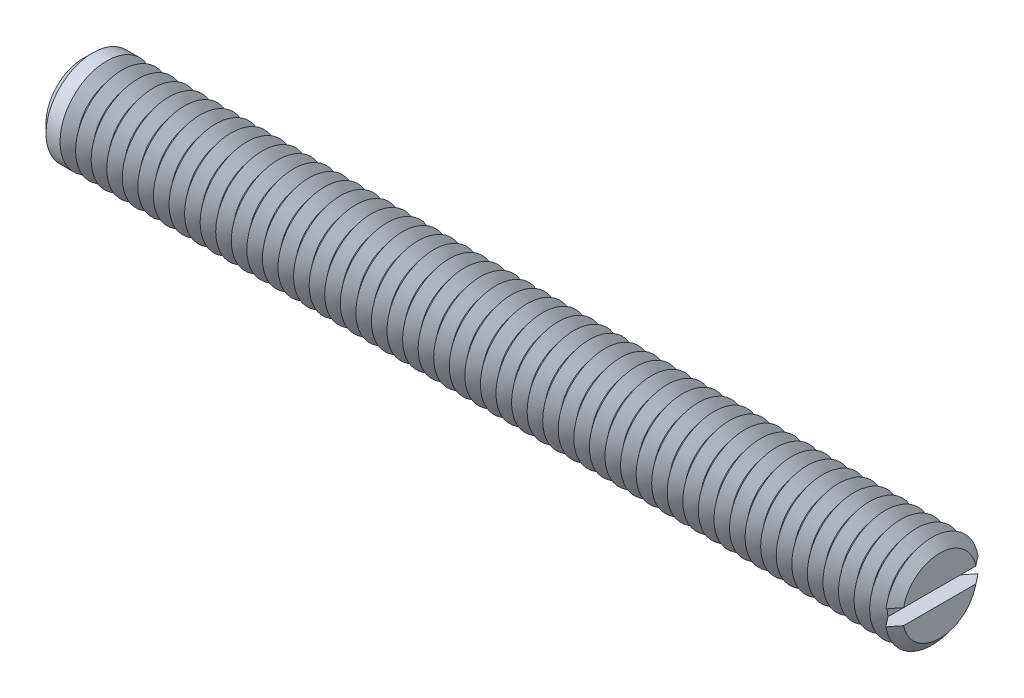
ISO-10303-21;
HEADER;
FILE_DESCRIPTION(('STEP AP214'),'2;1');
FILE_NAME('part.step','',(''),(''),'','','');
FILE_SCHEMA(('AUTOMOTIVE_DESIGN { 1 0 10303 214 1 1 1 1 }'));
ENDSEC;
DATA;
#1=APPLICATION_CONTEXT('core data for automotive mechanical design processes');
#2=APPLICATION_PROTOCOL_DEFINITION('international standard','automotive_design',2000,#1);
#3=PRODUCT_CONTEXT('',#1,'mechanical');
#4=PRODUCT('Part','Part','',(#3));
#5=PRODUCT_RELATED_PRODUCT_CATEGORY('part','',(#4));
#6=PRODUCT_DEFINITION_FORMATION('','',#4);
#7=PRODUCT_DEFINITION_CONTEXT('part definition',#1,'design');
#8=PRODUCT_DEFINITION('design','',#6,#7);
#9=PRODUCT_DEFINITION_SHAPE('','',#8);
#10=(LENGTH_UNIT() NAMED_UNIT(*) SI_UNIT(.MILLI.,.METRE.));
#11=(NAMED_UNIT(*) PLANE_ANGLE_UNIT() SI_UNIT($,.RADIAN.));
#12=(NAMED_UNIT(*) SI_UNIT($,.STERADIAN.) SOLID_ANGLE_UNIT());
#13=UNCERTAINTY_MEASURE_WITH_UNIT(LENGTH_MEASURE(1.E-05),#10,'distance_accuracy_value','');
#14=(GEOMETRIC_REPRESENTATION_CONTEXT(3) GLOBAL_UNCERTAINTY_ASSIGNED_CONTEXT((#13)) GLOBAL_UNIT_ASSIGNED_CONTEXT((#10,
#11,#12)) REPRESENTATION_CONTEXT('',''));
#15=CARTESIAN_POINT('',(0.,0.,0.));
#16=DIRECTION('',(0.,0.,1.));
#17=DIRECTION('',(1.,0.,0.));
#18=AXIS2_PLACEMENT_3D('',#15,#16,#17);
#19=CARTESIAN_POINT('',(27.,0.,0.));
#20=DIRECTION('',(1.,0.,0.));
#21=DIRECTION('',(0.,0.,-1.));
#22=AXIS2_PLACEMENT_3D('',#19,#20,#21);
#23=CONICAL_SURFACE('',#22,3.,0.895664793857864);
#24=CARTESIAN_POINT('',(27.,0.,0.));
#25=DIRECTION('',(-1.,0.,0.));
#26=DIRECTION('',(0.,0.,1.));
#27=AXIS2_PLACEMENT_3D('',#24,#25,#26);
#28=CIRCLE('',#27,3.);
#29=CARTESIAN_POINT('',(27.,-0.5,-2.95803989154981));
#30=VERTEX_POINT('',#29);
#31=CARTESIAN_POINT('',(27.,-0.5,2.95803989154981));
#32=VERTEX_POINT('',#31);
#33=EDGE_CURVE('E117',#30,#32,#28,.T.);
#34=ORIENTED_EDGE('',*,*,#33,.T.);
#35=CARTESIAN_POINT('',(29.8340158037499,-0.5,-6.52054251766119));
#36=CARTESIAN_POINT('',(29.6513674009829,-0.5,-6.29173953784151));
#37=CARTESIAN_POINT('',(29.4687482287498,-0.5,-6.0629132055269));
#38=CARTESIAN_POINT('',(29.1035782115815,-0.5,-5.60514706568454));
#39=CARTESIAN_POINT('',(28.9210273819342,-0.5,-5.37620724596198));
#40=CARTESIAN_POINT('',(28.5555297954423,-0.5,-4.91755222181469));
#41=CARTESIAN_POINT('',(28.3725834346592,-0.5,-4.6878367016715));
#42=CARTESIAN_POINT('',(28.0069310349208,-0.5,-4.22827290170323));
#43=CARTESIAN_POINT('',(27.8242249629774,-0.5,-3.99842464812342));
#44=CARTESIAN_POINT('',(27.4431833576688,-0.5,-3.51834247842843));
#45=CARTESIAN_POINT('',(27.244878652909,-0.5,-3.268084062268));
#46=CARTESIAN_POINT('',(26.9479597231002,-0.5,-2.89216906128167));
#47=CARTESIAN_POINT('',(26.8490516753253,-0.5,-2.76674461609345));
#48=CARTESIAN_POINT('',(26.6515374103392,-0.5,-2.51567085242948));
#49=CARTESIAN_POINT('',(26.5529311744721,-0.5,-2.39002154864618));
#50=CARTESIAN_POINT('',(26.3563868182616,-0.5,-2.1386227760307));
#51=CARTESIAN_POINT('',(26.2584477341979,-0.5,-2.01287406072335));
#52=CARTESIAN_POINT('',(26.0633111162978,-0.5,-1.7607527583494));
#53=CARTESIAN_POINT('',(25.9661137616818,-0.5,-1.63438003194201));
#54=CARTESIAN_POINT('',(25.8214734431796,-0.5,-1.4440341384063));
#55=CARTESIAN_POINT('',(25.7734745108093,-0.5,-1.38048388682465));
#56=CARTESIAN_POINT('',(25.6780284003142,-0.5,-1.25297092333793));
#57=CARTESIAN_POINT('',(25.630581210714,-0.5,-1.18900822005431));
#58=CARTESIAN_POINT('',(25.5365530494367,-0.5,-1.0604855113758));
#59=CARTESIAN_POINT('',(25.4899717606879,-0.5,-0.995925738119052));
#60=CARTESIAN_POINT('',(25.3981961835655,-0.5,-0.865829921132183));
#61=CARTESIAN_POINT('',(25.3530016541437,-0.5,-0.800294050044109));
#62=CARTESIAN_POINT('',(25.2995678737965,-0.5,-0.719528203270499));
#63=CARTESIAN_POINT('',(25.2901114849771,-0.5,-0.705104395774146));
#64=CARTESIAN_POINT('',(25.2713420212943,-0.5,-0.676163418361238));
#65=CARTESIAN_POINT('',(25.262028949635,-0.5,-0.661646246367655));
#66=CARTESIAN_POINT('',(25.2343355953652,-0.5,-0.617935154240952));
#67=CARTESIAN_POINT('',(25.2162024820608,-0.5,-0.588583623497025));
#68=CARTESIAN_POINT('',(25.1808134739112,-0.5,-0.529281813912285));
#69=CARTESIAN_POINT('',(25.1635591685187,-0.5,-0.499330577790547));
#70=CARTESIAN_POINT('',(25.130358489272,-0.5,-0.438714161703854));
#71=CARTESIAN_POINT('',(25.1144119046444,-0.5,-0.408049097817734));
#72=CARTESIAN_POINT('',(25.0785841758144,-0.5,-0.333745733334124));
#73=CARTESIAN_POINT('',(25.0595664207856,-0.5,-0.28967659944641));
#74=CARTESIAN_POINT('',(25.0278600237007,-0.5,-0.199412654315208));
#75=CARTESIAN_POINT('',(25.0151365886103,-0.5,-0.153231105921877));
#76=CARTESIAN_POINT('',(25.001111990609,-0.5,-0.0687562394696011));
#77=CARTESIAN_POINT('',(24.998005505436,-0.5,-0.0307838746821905));
#78=CARTESIAN_POINT('',(24.9988722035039,-0.5,0.0450573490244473));
#79=CARTESIAN_POINT('',(25.0028411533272,-0.5,0.0829262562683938));
#80=CARTESIAN_POINT('',(25.0147515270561,-0.5,0.146691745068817));
#81=CARTESIAN_POINT('',(25.0212166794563,-0.5,0.172890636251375));
#82=CARTESIAN_POINT('',(25.0365108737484,-0.5,0.224599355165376));
#83=CARTESIAN_POINT('',(25.0453416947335,-0.5,0.250108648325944));
#84=CARTESIAN_POINT('',(25.0648480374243,-0.5,0.300632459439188));
#85=CARTESIAN_POINT('',(25.0755378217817,-0.5,0.325641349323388));
#86=CARTESIAN_POINT('',(25.098235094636,-0.5,0.375035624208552));
#87=CARTESIAN_POINT('',(25.1102421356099,-0.5,0.399421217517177));
#88=CARTESIAN_POINT('',(25.1509435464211,-0.5,0.47810618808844));
#89=CARTESIAN_POINT('',(25.1816009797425,-0.5,0.531380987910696));
#90=CARTESIAN_POINT('',(25.2454790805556,-0.5,0.636383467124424));
#91=CARTESIAN_POINT('',(25.2787021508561,-0.5,0.688109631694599));
#92=CARTESIAN_POINT('',(25.3467342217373,-0.5,0.79068611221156));
#93=CARTESIAN_POINT('',(25.3815468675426,-0.5,0.84153400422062));
#94=CARTESIAN_POINT('',(25.4520982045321,-0.5,0.942545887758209));
#95=CARTESIAN_POINT('',(25.4878365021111,-0.5,0.992710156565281));
#96=CARTESIAN_POINT('',(25.5600131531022,-0.5,1.09268759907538));
#97=CARTESIAN_POINT('',(25.596452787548,-0.5,1.14249984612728));
#98=CARTESIAN_POINT('',(25.6697745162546,-0.5,1.24180476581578));
#99=CARTESIAN_POINT('',(25.7066566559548,-0.5,1.29129740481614));
#100=CARTESIAN_POINT('',(25.8176541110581,-0.5,1.43926830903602));
#101=CARTESIAN_POINT('',(25.8922352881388,-0.5,1.53739673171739));
#102=CARTESIAN_POINT('',(26.047080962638,-0.5,1.73962858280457));
#103=CARTESIAN_POINT('',(26.1273934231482,-0.5,1.84369513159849));
#104=CARTESIAN_POINT('',(26.2885076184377,-0.5,2.05144913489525));
#105=CARTESIAN_POINT('',(26.3693093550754,-0.5,2.15513658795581));
#106=CARTESIAN_POINT('',(26.6121843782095,-0.5,2.46584176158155));
#107=CARTESIAN_POINT('',(26.7747224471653,-0.5,2.67249578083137));
#108=CARTESIAN_POINT('',(27.1005180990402,-0.5,3.08548885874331));
#109=CARTESIAN_POINT('',(27.2637761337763,-0.5,3.29182756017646));
#110=CARTESIAN_POINT('',(27.5906371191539,-0.5,3.70422676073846));
#111=CARTESIAN_POINT('',(27.7542400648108,-0.5,3.9102872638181));
#112=CARTESIAN_POINT('',(28.0774242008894,-0.5,4.31690950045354));
#113=CARTESIAN_POINT('',(28.2369999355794,-0.5,4.51747557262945));
#114=CARTESIAN_POINT('',(28.5562886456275,-0.5,4.91850000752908));
#115=CARTESIAN_POINT('',(28.7160016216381,-0.5,5.11895836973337));
#116=CARTESIAN_POINT('',(29.0353926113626,-0.5,5.51963619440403));
#117=CARTESIAN_POINT('',(29.1950705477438,-0.5,5.71985571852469));
#118=CARTESIAN_POINT('',(29.5144964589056,-0.5,6.12023723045));
#119=CARTESIAN_POINT('',(29.6742444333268,-0.5,6.32039921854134));
#120=CARTESIAN_POINT('',(29.8340158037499,-0.5,6.52054251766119));
#121=B_SPLINE_CURVE_WITH_KNOTS('',3,(#35,#36,#37,#38,#39,#40,#41,#42,#43,#44,#45,#46,#47,#48,
#49,#50,#51,#52,#53,#54,#55,#56,#57,#58,#59,#60,#61,#62,#63,#64,#65,#66,#67,#68,#69,#70,#71,#72,
#73,#74,#75,#76,#77,#78,#79,#80,#81,#82,#83,#84,#85,#86,#87,#88,#89,#90,#91,#92,#93,#94,#95,#96,
#97,#98,#99,#100,#101,#102,#103,#104,#105,#106,#107,#108,#109,#110,#111,#112,#113,#114,#115,
#116,#117,#118,#119,#120),.UNSPECIFIED.,.F.,.F.,(4,2,2,2,2,2,2,2,2,2,2,2,2,2,2,2,2,2,2,2,2,2,2,
2,2,2,2,2,2,2,2,2,2,2,2,2,2,2,2,2,2,2,4),(0.,0.878294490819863,1.75672728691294,
2.63771941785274,3.51857435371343,4.47648054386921,4.9556742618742,5.43483773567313,
5.91300334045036,6.39128103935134,6.63019943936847,6.86911286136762,7.10793700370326,
7.34671939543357,7.39846053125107,7.45020282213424,7.55369448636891,7.65736712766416,
7.76102302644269,7.90476612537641,8.04770552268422,8.16137782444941,8.27498213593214,
8.35581399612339,8.43670681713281,8.51825011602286,8.59976579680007,8.78399479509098,
8.96839847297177,9.15324864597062,9.33802146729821,9.52317177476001,9.70834126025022,
10.0780963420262,10.472454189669,10.8668135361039,11.65555692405,12.4448978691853,
13.2342274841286,14.0031360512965,14.7720482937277,15.5403347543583,16.3086173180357),.UNSPECIFIED.);
#122=CARTESIAN_POINT('',(26.5,-0.5,2.32228361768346));
#123=VERTEX_POINT('',#122);
#124=EDGE_CURVE('E109',#123,#32,#121,.T.);
#125=ORIENTED_EDGE('',*,*,#124,.F.);
#126=CARTESIAN_POINT('',(26.5,0.,0.));
#127=DIRECTION('',(-1.,0.,0.));
#128=DIRECTION('',(0.,0.,1.));
#129=AXIS2_PLACEMENT_3D('',#126,#127,#128);
#130=CIRCLE('',#129,2.37550020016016);
#131=CARTESIAN_POINT('',(26.5,-0.5,-2.32228361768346));
#132=VERTEX_POINT('',#131);
#133=EDGE_CURVE('E647',#132,#123,#130,.T.);
#134=ORIENTED_EDGE('',*,*,#133,.F.);
#135=EDGE_CURVE('E58',#30,#132,#121,.T.);
#136=ORIENTED_EDGE('',*,*,#135,.F.);
#137=EDGE_LOOP('',(#34,#125,#134,#136));
#138=FACE_BOUND('',#137,.T.);
#139=ADVANCED_FACE('F37',(#138),#23,.T.);
#140=CARTESIAN_POINT('',(27.,0.5,2.95803989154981));
#141=VERTEX_POINT('',#140);
#142=CARTESIAN_POINT('',(27.,0.5,-2.95803989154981));
#143=VERTEX_POINT('',#142);
#144=EDGE_CURVE('E100',#141,#143,#28,.T.);
#145=ORIENTED_EDGE('',*,*,#144,.T.);
#146=CARTESIAN_POINT('',(29.8340158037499,0.5,6.52054251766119));
#147=CARTESIAN_POINT('',(29.6513674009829,0.5,6.29173953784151));
#148=CARTESIAN_POINT('',(29.4687482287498,0.5,6.0629132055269));
#149=CARTESIAN_POINT('',(29.1035782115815,0.5,5.60514706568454));
#150=CARTESIAN_POINT('',(28.9210273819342,0.5,5.37620724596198));
#151=CARTESIAN_POINT('',(28.5555297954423,0.5,4.91755222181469));
#152=CARTESIAN_POINT('',(28.3725834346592,0.5,4.6878367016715));
#153=CARTESIAN_POINT('',(28.0069310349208,0.5,4.22827290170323));
#154=CARTESIAN_POINT('',(27.8242249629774,0.5,3.99842464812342));
#155=CARTESIAN_POINT('',(27.4431833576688,0.5,3.51834247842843));
#156=CARTESIAN_POINT('',(27.244878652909,0.5,3.268084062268));
#157=CARTESIAN_POINT('',(26.9479597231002,0.5,2.89216906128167));
#158=CARTESIAN_POINT('',(26.8490516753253,0.5,2.76674461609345));
#159=CARTESIAN_POINT('',(26.6515374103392,0.5,2.51567085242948));
#160=CARTESIAN_POINT('',(26.5529311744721,0.5,2.39002154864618));
#161=CARTESIAN_POINT('',(26.3563868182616,0.5,2.1386227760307));
#162=CARTESIAN_POINT('',(26.2584477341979,0.5,2.01287406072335));
#163=CARTESIAN_POINT('',(26.0633111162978,0.5,1.7607527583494));
#164=CARTESIAN_POINT('',(25.9661137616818,0.5,1.63438003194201));
#165=CARTESIAN_POINT('',(25.8214734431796,0.5,1.4440341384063));
#166=CARTESIAN_POINT('',(25.7734745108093,0.5,1.38048388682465));
#167=CARTESIAN_POINT('',(25.6780284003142,0.5,1.25297092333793));
#168=CARTESIAN_POINT('',(25.630581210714,0.5,1.18900822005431));
#169=CARTESIAN_POINT('',(25.5365530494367,0.5,1.0604855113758));
#170=CARTESIAN_POINT('',(25.4899717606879,0.5,0.995925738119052));
#171=CARTESIAN_POINT('',(25.3981961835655,0.5,0.865829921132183));
#172=CARTESIAN_POINT('',(25.3530016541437,0.5,0.800294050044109));
#173=CARTESIAN_POINT('',(25.2995678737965,0.5,0.719528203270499));
#174=CARTESIAN_POINT('',(25.2901114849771,0.5,0.705104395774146));
#175=CARTESIAN_POINT('',(25.2713420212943,0.5,0.676163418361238));
#176=CARTESIAN_POINT('',(25.262028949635,0.5,0.661646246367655));
#177=CARTESIAN_POINT('',(25.2343355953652,0.5,0.617935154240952));
#178=CARTESIAN_POINT('',(25.2162024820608,0.5,0.588583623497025));
#179=CARTESIAN_POINT('',(25.1808134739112,0.5,0.529281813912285));
#180=CARTESIAN_POINT('',(25.1635591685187,0.5,0.499330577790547));
#181=CARTESIAN_POINT('',(25.130358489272,0.5,0.438714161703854));
#182=CARTESIAN_POINT('',(25.1144119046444,0.5,0.408049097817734));
#183=CARTESIAN_POINT('',(25.0785841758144,0.5,0.333745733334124));
#184=CARTESIAN_POINT('',(25.0595664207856,0.5,0.28967659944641));
#185=CARTESIAN_POINT('',(25.0278600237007,0.5,0.199412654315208));
#186=CARTESIAN_POINT('',(25.0151365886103,0.5,0.153231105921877));
#187=CARTESIAN_POINT('',(25.001111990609,0.5,0.0687562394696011));
#188=CARTESIAN_POINT('',(24.998005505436,0.5,0.0307838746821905));
#189=CARTESIAN_POINT('',(24.9988722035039,0.5,-0.0450573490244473));
#190=CARTESIAN_POINT('',(25.0028411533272,0.5,-0.0829262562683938));
#191=CARTESIAN_POINT('',(25.0147515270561,0.5,-0.146691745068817));
#192=CARTESIAN_POINT('',(25.0212166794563,0.5,-0.172890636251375));
#193=CARTESIAN_POINT('',(25.0365108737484,0.5,-0.224599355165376));
#194=CARTESIAN_POINT('',(25.0453416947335,0.5,-0.250108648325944));
#195=CARTESIAN_POINT('',(25.0648480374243,0.5,-0.300632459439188));
#196=CARTESIAN_POINT('',(25.0755378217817,0.5,-0.325641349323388));
#197=CARTESIAN_POINT('',(25.098235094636,0.5,-0.375035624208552));
#198=CARTESIAN_POINT('',(25.1102421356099,0.5,-0.399421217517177));
#199=CARTESIAN_POINT('',(25.1509435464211,0.5,-0.47810618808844));
#200=CARTESIAN_POINT('',(25.1816009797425,0.5,-0.531380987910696));
#201=CARTESIAN_POINT('',(25.2454790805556,0.5,-0.636383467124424));
#202=CARTESIAN_POINT('',(25.2787021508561,0.5,-0.688109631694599));
#203=CARTESIAN_POINT('',(25.3467342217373,0.5,-0.79068611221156));
#204=CARTESIAN_POINT('',(25.3815468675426,0.5,-0.84153400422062));
#205=CARTESIAN_POINT('',(25.4520982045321,0.5,-0.942545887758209));
#206=CARTESIAN_POINT('',(25.4878365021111,0.5,-0.992710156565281));
#207=CARTESIAN_POINT('',(25.5600131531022,0.5,-1.09268759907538));
#208=CARTESIAN_POINT('',(25.596452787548,0.5,-1.14249984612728));
#209=CARTESIAN_POINT('',(25.6697745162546,0.5,-1.24180476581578));
#210=CARTESIAN_POINT('',(25.7066566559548,0.5,-1.29129740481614));
#211=CARTESIAN_POINT('',(25.8176541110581,0.5,-1.43926830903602));
#212=CARTESIAN_POINT('',(25.8922352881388,0.5,-1.53739673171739));
#213=CARTESIAN_POINT('',(26.047080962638,0.5,-1.73962858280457));
#214=CARTESIAN_POINT('',(26.1273934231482,0.5,-1.84369513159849));
#215=CARTESIAN_POINT('',(26.2885076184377,0.5,-2.05144913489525));
#216=CARTESIAN_POINT('',(26.3693093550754,0.5,-2.15513658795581));
#217=CARTESIAN_POINT('',(26.6121843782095,0.5,-2.46584176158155));
#218=CARTESIAN_POINT('',(26.7747224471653,0.5,-2.67249578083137));
#219=CARTESIAN_POINT('',(27.1005180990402,0.5,-3.08548885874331));
#220=CARTESIAN_POINT('',(27.2637761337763,0.5,-3.29182756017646));
#221=CARTESIAN_POINT('',(27.5906371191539,0.5,-3.70422676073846));
#222=CARTESIAN_POINT('',(27.7542400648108,0.5,-3.9102872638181));
#223=CARTESIAN_POINT('',(28.0774242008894,0.5,-4.31690950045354));
#224=CARTESIAN_POINT('',(28.2369999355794,0.5,-4.51747557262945));
#225=CARTESIAN_POINT('',(28.5562886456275,0.5,-4.91850000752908));
#226=CARTESIAN_POINT('',(28.7160016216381,0.5,-5.11895836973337));
#227=CARTESIAN_POINT('',(29.0353926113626,0.5,-5.51963619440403));
#228=CARTESIAN_POINT('',(29.1950705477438,0.5,-5.71985571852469));
#229=CARTESIAN_POINT('',(29.5144964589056,0.5,-6.12023723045));
#230=CARTESIAN_POINT('',(29.6742444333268,0.5,-6.32039921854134));
#231=CARTESIAN_POINT('',(29.8340158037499,0.5,-6.52054251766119));
#232=B_SPLINE_CURVE_WITH_KNOTS('',3,(#146,#147,#148,#149,#150,#151,#152,#153,#154,#155,#156,
#157,#158,#159,#160,#161,#162,#163,#164,#165,#166,#167,#168,#169,#170,#171,#172,#173,#174,#175,
#176,#177,#178,#179,#180,#181,#182,#183,#184,#185,#186,#187,#188,#189,#190,#191,#192,#193,#194,
#195,#196,#197,#198,#199,#200,#201,#202,#203,#204,#205,#206,#207,#208,#209,#210,#211,#212,#213,
#214,#215,#216,#217,#218,#219,#220,#221,#222,#223,#224,#225,#226,#227,#228,#229,#230,#231),
.UNSPECIFIED.,.F.,.F.,(4,2,2,2,2,2,2,2,2,2,2,2,2,2,2,2,2,2,2,2,2,2,2,2,2,2,2,2,2,2,2,2,2,2,2,2,
2,2,2,2,2,2,4),(0.,0.878294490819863,1.75672728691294,2.63771941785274,3.51857435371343,
4.47648054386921,4.9556742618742,5.43483773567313,5.91300334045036,6.39128103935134,
6.63019943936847,6.86911286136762,7.10793700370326,7.34671939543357,7.39846053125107,
7.45020282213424,7.55369448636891,7.65736712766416,7.76102302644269,7.90476612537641,
8.04770552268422,8.16137782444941,8.27498213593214,8.35581399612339,8.43670681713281,
8.51825011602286,8.59976579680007,8.78399479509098,8.96839847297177,9.15324864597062,
9.33802146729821,9.52317177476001,9.70834126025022,10.0780963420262,10.472454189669,
10.8668135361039,11.65555692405,12.4448978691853,13.2342274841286,14.0031360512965,
14.7720482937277,15.5403347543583,16.3086173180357),.UNSPECIFIED.);
#233=CARTESIAN_POINT('',(26.5,0.5,-2.32228361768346));
#234=VERTEX_POINT('',#233);
#235=EDGE_CURVE('E110',#234,#143,#232,.T.);
#236=ORIENTED_EDGE('',*,*,#235,.F.);
#237=CARTESIAN_POINT('',(26.5,0.5,2.32228361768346));
#238=VERTEX_POINT('',#237);
#239=EDGE_CURVE('E103',#238,#234,#130,.T.);
#240=ORIENTED_EDGE('',*,*,#239,.F.);
#241=EDGE_CURVE('E97',#141,#238,#232,.T.);
#242=ORIENTED_EDGE('',*,*,#241,.F.);
#243=EDGE_LOOP('',(#145,#236,#240,#242));
#244=FACE_BOUND('',#243,.T.);
#245=ADVANCED_FACE('F99',(#244),#23,.T.);
#246=CARTESIAN_POINT('',(26.5,0.,0.));
#247=DIRECTION('',(-1.,0.,0.));
#248=DIRECTION('',(0.,0.,1.));
#249=AXIS2_PLACEMENT_3D('',#246,#247,#248);
#250=CONICAL_SURFACE('',#249,2.37550020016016,0.895664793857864);
#251=CARTESIAN_POINT('',(26.,0.,0.));
#252=DIRECTION('',(-1.,0.,0.));
#253=DIRECTION('',(0.,0.,1.));
#254=AXIS2_PLACEMENT_3D('',#251,#252,#253);
#255=CIRCLE('',#254,3.);
#256=CARTESIAN_POINT('',(26.,0.,3.));
#257=VERTEX_POINT('',#256);
#258=EDGE_CURVE('E632',#257,#257,#255,.T.);
#259=ORIENTED_EDGE('',*,*,#258,.F.);
#260=EDGE_LOOP('',(#259));
#261=FACE_BOUND('',#260,.T.);
#262=ORIENTED_EDGE('',*,*,#239,.T.);
#263=EDGE_CURVE('E641',#234,#132,#130,.T.);
#264=ORIENTED_EDGE('',*,*,#263,.T.);
#265=ORIENTED_EDGE('',*,*,#133,.T.);
#266=EDGE_CURVE('E639',#123,#238,#130,.T.);
#267=ORIENTED_EDGE('',*,*,#266,.T.);
#268=EDGE_LOOP('',(#262,#264,#265,#267));
#269=FACE_BOUND('',#268,.T.);
#270=ADVANCED_FACE('F168',(#261,#269),#250,.T.);
#271=CARTESIAN_POINT('',(27.5,0.,0.));
#272=DIRECTION('',(1.,0.,0.));
#273=DIRECTION('',(0.,0.,-1.));
#274=AXIS2_PLACEMENT_3D('',#271,#272,#273);
#275=PLANE('',#274);
#276=CARTESIAN_POINT('',(27.5,0.,0.));
#277=DIRECTION('',(-1.,0.,0.));
#278=DIRECTION('',(0.,0.,1.));
#279=AXIS2_PLACEMENT_3D('',#276,#277,#278);
#280=CIRCLE('',#279,2.37550020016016);
#281=CARTESIAN_POINT('',(27.5,0.5,2.32228361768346));
#282=VERTEX_POINT('',#281);
#283=CARTESIAN_POINT('',(27.5,0.5,-2.32228361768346));
#284=VERTEX_POINT('',#283);
#285=EDGE_CURVE('E160',#282,#284,#280,.T.);
#286=ORIENTED_EDGE('',*,*,#285,.F.);
#287=DIRECTION('',(0.,0.,1.));
#288=VECTOR('',#287,1.);
#289=CARTESIAN_POINT('',(27.5,0.5,0.));
#290=LINE('',#289,#288);
#291=EDGE_CURVE('E122',#284,#282,#290,.T.);
#292=ORIENTED_EDGE('',*,*,#291,.F.);
#293=EDGE_LOOP('',(#286,#292));
#294=FACE_BOUND('',#293,.T.);
#295=ADVANCED_FACE('F172',(#294),#275,.T.);
#296=CARTESIAN_POINT('',(27.5,-0.5,-2.32228361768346));
#297=VERTEX_POINT('',#296);
#298=CARTESIAN_POINT('',(27.5,-0.5,2.32228361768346));
#299=VERTEX_POINT('',#298);
#300=EDGE_CURVE('E66',#297,#299,#280,.T.);
#301=ORIENTED_EDGE('',*,*,#300,.F.);
#302=DIRECTION('',(0.,0.,-1.));
#303=VECTOR('',#302,1.);
#304=CARTESIAN_POINT('',(27.5,-0.5,0.));
#305=LINE('',#304,#303);
#306=EDGE_CURVE('E136',#299,#297,#305,.T.);
#307=ORIENTED_EDGE('',*,*,#306,.F.);
#308=EDGE_LOOP('',(#301,#307));
#309=FACE_BOUND('',#308,.T.);
#310=ADVANCED_FACE('F200',(#309),#275,.T.);
#311=CARTESIAN_POINT('',(27.5,0.,0.));
#312=DIRECTION('',(-1.,0.,0.));
#313=DIRECTION('',(0.,0.,1.));
#314=AXIS2_PLACEMENT_3D('',#311,#312,#313);
#315=CONICAL_SURFACE('',#314,2.37550020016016,0.895664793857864);
#316=ORIENTED_EDGE('',*,*,#144,.F.);
#317=CARTESIAN_POINT('',(24.1659841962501,0.5,-6.52054251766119));
#318=CARTESIAN_POINT('',(24.3486325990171,0.5,-6.29173953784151));
#319=CARTESIAN_POINT('',(24.5312517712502,0.5,-6.06291320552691));
#320=CARTESIAN_POINT('',(24.8964217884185,0.5,-5.60514706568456));
#321=CARTESIAN_POINT('',(25.0789726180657,0.5,-5.37620724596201));
#322=CARTESIAN_POINT('',(25.4444702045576,0.5,-4.91755222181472));
#323=CARTESIAN_POINT('',(25.6274165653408,0.5,-4.68783670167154));
#324=CARTESIAN_POINT('',(25.9930689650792,0.5,-4.22827290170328));
#325=CARTESIAN_POINT('',(26.1757750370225,0.5,-3.99842464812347));
#326=CARTESIAN_POINT('',(26.5568166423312,0.5,-3.51834247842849));
#327=CARTESIAN_POINT('',(26.7551213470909,0.5,-3.26808406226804));
#328=CARTESIAN_POINT('',(27.0520402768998,0.5,-2.89216906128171));
#329=CARTESIAN_POINT('',(27.1509483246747,0.5,-2.76674461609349));
#330=CARTESIAN_POINT('',(27.3484625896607,0.5,-2.51567085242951));
#331=CARTESIAN_POINT('',(27.4470688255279,0.5,-2.39002154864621));
#332=CARTESIAN_POINT('',(27.6436131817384,0.5,-2.13862277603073));
#333=CARTESIAN_POINT('',(27.7415522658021,0.5,-2.01287406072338));
#334=CARTESIAN_POINT('',(27.9366888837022,0.5,-1.76075275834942));
#335=CARTESIAN_POINT('',(28.0338862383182,0.5,-1.63438003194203));
#336=CARTESIAN_POINT('',(28.1785265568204,0.5,-1.4440341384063));
#337=CARTESIAN_POINT('',(28.2265254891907,0.5,-1.38048388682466));
#338=CARTESIAN_POINT('',(28.3219715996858,0.5,-1.25297092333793));
#339=CARTESIAN_POINT('',(28.369418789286,0.5,-1.18900822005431));
#340=CARTESIAN_POINT('',(28.4634469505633,0.5,-1.06048551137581));
#341=CARTESIAN_POINT('',(28.5100282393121,0.5,-0.995925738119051));
#342=CARTESIAN_POINT('',(28.6018038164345,0.5,-0.865829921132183));
#343=CARTESIAN_POINT('',(28.6469983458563,0.5,-0.800294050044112));
#344=CARTESIAN_POINT('',(28.7004321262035,0.5,-0.719528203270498));
#345=CARTESIAN_POINT('',(28.7098885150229,0.5,-0.705104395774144));
#346=CARTESIAN_POINT('',(28.7286579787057,0.5,-0.676163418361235));
#347=CARTESIAN_POINT('',(28.737971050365,0.5,-0.661646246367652));
#348=CARTESIAN_POINT('',(28.7656644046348,0.5,-0.61793515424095));
#349=CARTESIAN_POINT('',(28.7837975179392,0.5,-0.588583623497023));
#350=CARTESIAN_POINT('',(28.8191865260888,0.5,-0.529281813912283));
#351=CARTESIAN_POINT('',(28.8364408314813,0.5,-0.499330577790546));
#352=CARTESIAN_POINT('',(28.869641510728,0.5,-0.438714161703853));
#353=CARTESIAN_POINT('',(28.8855880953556,0.5,-0.408049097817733));
#354=CARTESIAN_POINT('',(28.9214158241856,0.5,-0.333745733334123));
#355=CARTESIAN_POINT('',(28.9404335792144,0.5,-0.289676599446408));
#356=CARTESIAN_POINT('',(28.9721399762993,0.5,-0.199412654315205));
#357=CARTESIAN_POINT('',(28.9848634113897,0.5,-0.153231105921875));
#358=CARTESIAN_POINT('',(28.998888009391,0.5,-0.068756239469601));
#359=CARTESIAN_POINT('',(29.001994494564,0.5,-0.0307838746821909));
#360=CARTESIAN_POINT('',(29.0011277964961,0.5,0.0450573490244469));
#361=CARTESIAN_POINT('',(28.9971588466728,0.5,0.0829262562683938));
#362=CARTESIAN_POINT('',(28.9852484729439,0.5,0.146691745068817));
#363=CARTESIAN_POINT('',(28.9787833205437,0.5,0.172890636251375));
#364=CARTESIAN_POINT('',(28.9634891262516,0.5,0.224599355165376));
#365=CARTESIAN_POINT('',(28.9546583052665,0.5,0.250108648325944));
#366=CARTESIAN_POINT('',(28.9351519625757,0.5,0.30063245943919));
#367=CARTESIAN_POINT('',(28.9244621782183,0.5,0.325641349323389));
#368=CARTESIAN_POINT('',(28.901764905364,0.5,0.375035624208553));
#369=CARTESIAN_POINT('',(28.8897578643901,0.5,0.399421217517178));
#370=CARTESIAN_POINT('',(28.8490564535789,0.5,0.47810618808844));
#371=CARTESIAN_POINT('',(28.8183990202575,0.5,0.531380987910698));
#372=CARTESIAN_POINT('',(28.7545209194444,0.5,0.636383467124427));
#373=CARTESIAN_POINT('',(28.7212978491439,0.5,0.688109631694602));
#374=CARTESIAN_POINT('',(28.6532657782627,0.5,0.790686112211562));
#375=CARTESIAN_POINT('',(28.6184531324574,0.5,0.841534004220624));
#376=CARTESIAN_POINT('',(28.5479017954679,0.5,0.942545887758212));
#377=CARTESIAN_POINT('',(28.5121634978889,0.5,0.992710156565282));
#378=CARTESIAN_POINT('',(28.4399868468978,0.5,1.09268759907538));
#379=CARTESIAN_POINT('',(28.403547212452,0.5,1.14249984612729));
#380=CARTESIAN_POINT('',(28.3302254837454,0.5,1.24180476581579));
#381=CARTESIAN_POINT('',(28.2933433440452,0.5,1.29129740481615));
#382=CARTESIAN_POINT('',(28.1823458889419,0.5,1.43926830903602));
#383=CARTESIAN_POINT('',(28.1077647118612,0.5,1.5373967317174));
#384=CARTESIAN_POINT('',(27.952919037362,0.5,1.73962858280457));
#385=CARTESIAN_POINT('',(27.8726065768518,0.5,1.84369513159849));
#386=CARTESIAN_POINT('',(27.7114923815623,0.5,2.05144913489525));
#387=CARTESIAN_POINT('',(27.6306906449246,0.5,2.15513658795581));
#388=CARTESIAN_POINT('',(27.3878156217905,0.5,2.46584176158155));
#389=CARTESIAN_POINT('',(27.2252775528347,0.5,2.67249578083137));
#390=CARTESIAN_POINT('',(26.8994819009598,0.5,3.0854888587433));
#391=CARTESIAN_POINT('',(26.7362238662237,0.5,3.29182756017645));
#392=CARTESIAN_POINT('',(26.4093628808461,0.5,3.70422676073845));
#393=CARTESIAN_POINT('',(26.2457599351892,0.5,3.91028726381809));
#394=CARTESIAN_POINT('',(25.9225757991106,0.5,4.31690950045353));
#395=CARTESIAN_POINT('',(25.7630000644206,0.5,4.51747557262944));
#396=CARTESIAN_POINT('',(25.4437113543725,0.5,4.91850000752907));
#397=CARTESIAN_POINT('',(25.2839983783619,0.5,5.11895836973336));
#398=CARTESIAN_POINT('',(24.9646073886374,0.5,5.51963619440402));
#399=CARTESIAN_POINT('',(24.8049294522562,0.5,5.71985571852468));
#400=CARTESIAN_POINT('',(24.4855035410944,0.5,6.12023723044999));
#401=CARTESIAN_POINT('',(24.3257555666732,0.5,6.32039921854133));
#402=CARTESIAN_POINT('',(24.1659841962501,0.5,6.52054251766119));
#403=B_SPLINE_CURVE_WITH_KNOTS('',3,(#317,#318,#319,#320,#321,#322,#323,#324,#325,#326,#327,
#328,#329,#330,#331,#332,#333,#334,#335,#336,#337,#338,#339,#340,#341,#342,#343,#344,#345,#346,
#347,#348,#349,#350,#351,#352,#353,#354,#355,#356,#357,#358,#359,#360,#361,#362,#363,#364,#365,
#366,#367,#368,#369,#370,#371,#372,#373,#374,#375,#376,#377,#378,#379,#380,#381,#382,#383,#384,
#385,#386,#387,#388,#389,#390,#391,#392,#393,#394,#395,#396,#397,#398,#399,#400,#401,#402),
.UNSPECIFIED.,.F.,.F.,(4,2,2,2,2,2,2,2,2,2,2,2,2,2,2,2,2,2,2,2,2,2,2,2,2,2,2,2,2,2,2,2,2,2,2,2,
2,2,2,2,2,2,4),(0.,0.878294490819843,1.7567272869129,2.63771941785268,3.51857435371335,
4.47648054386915,4.95567426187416,5.4348377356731,5.91300334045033,6.39128103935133,
6.63019943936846,6.86911286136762,7.10793700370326,7.34671939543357,7.39846053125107,
7.45020282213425,7.55369448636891,7.65736712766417,7.7610230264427,7.90476612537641,
8.04770552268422,8.16137782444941,8.27498213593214,8.35581399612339,8.43670681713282,
8.51825011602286,8.59976579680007,8.78399479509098,8.96839847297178,9.15324864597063,
9.33802146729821,9.52317177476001,9.70834126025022,10.0780963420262,10.472454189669,
10.8668135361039,11.65555692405,12.4448978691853,13.2342274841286,14.0031360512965,
14.7720482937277,15.5403347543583,16.3086173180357),.UNSPECIFIED.);
#404=EDGE_CURVE('E41',#282,#141,#403,.T.);
#405=ORIENTED_EDGE('',*,*,#404,.F.);
#406=ORIENTED_EDGE('',*,*,#285,.T.);
#407=EDGE_CURVE('E11',#143,#284,#403,.T.);
#408=ORIENTED_EDGE('',*,*,#407,.F.);
#409=EDGE_LOOP('',(#316,#405,#406,#408));
#410=FACE_BOUND('',#409,.T.);
#411=ADVANCED_FACE('F114',(#410),#315,.T.);
#412=CARTESIAN_POINT('',(27.5,0.5,-4.5));
#413=DIRECTION('',(0.,1.,0.));
#414=DIRECTION('',(0.,0.,1.));
#415=AXIS2_PLACEMENT_3D('',#412,#413,#414);
#416=PLANE('',#415);
#417=ORIENTED_EDGE('',*,*,#404,.T.);
#418=ORIENTED_EDGE('',*,*,#241,.T.);
#419=DIRECTION('',(0.,0.,1.));
#420=VECTOR('',#419,1.);
#421=CARTESIAN_POINT('',(26.5,0.5,-4.5));
#422=LINE('',#421,#420);
#423=EDGE_CURVE('E145',#234,#238,#422,.T.);
#424=ORIENTED_EDGE('',*,*,#423,.F.);
#425=ORIENTED_EDGE('',*,*,#235,.T.);
#426=ORIENTED_EDGE('',*,*,#407,.T.);
#427=ORIENTED_EDGE('',*,*,#291,.T.);
#428=EDGE_LOOP('',(#417,#418,#424,#425,#426,#427));
#429=FACE_BOUND('',#428,.T.);
#430=ADVANCED_FACE('F120',(#429),#416,.F.);
#431=ORIENTED_EDGE('',*,*,#33,.F.);
#432=CARTESIAN_POINT('',(24.1659841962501,-0.5,6.52054251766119));
#433=CARTESIAN_POINT('',(24.3486325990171,-0.5,6.29173953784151));
#434=CARTESIAN_POINT('',(24.5312517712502,-0.5,6.06291320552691));
#435=CARTESIAN_POINT('',(24.8964217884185,-0.5,5.60514706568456));
#436=CARTESIAN_POINT('',(25.0789726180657,-0.5,5.37620724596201));
#437=CARTESIAN_POINT('',(25.4444702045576,-0.5,4.91755222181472));
#438=CARTESIAN_POINT('',(25.6274165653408,-0.5,4.68783670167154));
#439=CARTESIAN_POINT('',(25.9930689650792,-0.5,4.22827290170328));
#440=CARTESIAN_POINT('',(26.1757750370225,-0.5,3.99842464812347));
#441=CARTESIAN_POINT('',(26.5568166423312,-0.5,3.51834247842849));
#442=CARTESIAN_POINT('',(26.7551213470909,-0.5,3.26808406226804));
#443=CARTESIAN_POINT('',(27.0520402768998,-0.5,2.89216906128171));
#444=CARTESIAN_POINT('',(27.1509483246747,-0.5,2.76674461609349));
#445=CARTESIAN_POINT('',(27.3484625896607,-0.5,2.51567085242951));
#446=CARTESIAN_POINT('',(27.4470688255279,-0.5,2.39002154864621));
#447=CARTESIAN_POINT('',(27.6436131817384,-0.5,2.13862277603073));
#448=CARTESIAN_POINT('',(27.7415522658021,-0.5,2.01287406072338));
#449=CARTESIAN_POINT('',(27.9366888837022,-0.5,1.76075275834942));
#450=CARTESIAN_POINT('',(28.0338862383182,-0.5,1.63438003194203));
#451=CARTESIAN_POINT('',(28.1785265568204,-0.5,1.4440341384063));
#452=CARTESIAN_POINT('',(28.2265254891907,-0.5,1.38048388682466));
#453=CARTESIAN_POINT('',(28.3219715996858,-0.5,1.25297092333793));
#454=CARTESIAN_POINT('',(28.369418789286,-0.5,1.18900822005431));
#455=CARTESIAN_POINT('',(28.4634469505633,-0.5,1.06048551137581));
#456=CARTESIAN_POINT('',(28.5100282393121,-0.5,0.995925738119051));
#457=CARTESIAN_POINT('',(28.6018038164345,-0.5,0.865829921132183));
#458=CARTESIAN_POINT('',(28.6469983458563,-0.5,0.800294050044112));
#459=CARTESIAN_POINT('',(28.7004321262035,-0.5,0.719528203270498));
#460=CARTESIAN_POINT('',(28.7098885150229,-0.5,0.705104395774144));
#461=CARTESIAN_POINT('',(28.7286579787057,-0.5,0.676163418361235));
#462=CARTESIAN_POINT('',(28.737971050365,-0.5,0.661646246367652));
#463=CARTESIAN_POINT('',(28.7656644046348,-0.5,0.61793515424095));
#464=CARTESIAN_POINT('',(28.7837975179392,-0.5,0.588583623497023));
#465=CARTESIAN_POINT('',(28.8191865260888,-0.5,0.529281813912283));
#466=CARTESIAN_POINT('',(28.8364408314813,-0.5,0.499330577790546));
#467=CARTESIAN_POINT('',(28.869641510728,-0.5,0.438714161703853));
#468=CARTESIAN_POINT('',(28.8855880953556,-0.5,0.408049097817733));
#469=CARTESIAN_POINT('',(28.9214158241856,-0.5,0.333745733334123));
#470=CARTESIAN_POINT('',(28.9404335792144,-0.5,0.289676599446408));
#471=CARTESIAN_POINT('',(28.9721399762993,-0.5,0.199412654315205));
#472=CARTESIAN_POINT('',(28.9848634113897,-0.5,0.153231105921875));
#473=CARTESIAN_POINT('',(28.998888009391,-0.5,0.068756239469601));
#474=CARTESIAN_POINT('',(29.001994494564,-0.5,0.0307838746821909));
#475=CARTESIAN_POINT('',(29.0011277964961,-0.5,-0.0450573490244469));
#476=CARTESIAN_POINT('',(28.9971588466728,-0.5,-0.0829262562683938));
#477=CARTESIAN_POINT('',(28.9852484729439,-0.5,-0.146691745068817));
#478=CARTESIAN_POINT('',(28.9787833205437,-0.5,-0.172890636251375));
#479=CARTESIAN_POINT('',(28.9634891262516,-0.5,-0.224599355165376));
#480=CARTESIAN_POINT('',(28.9546583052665,-0.5,-0.250108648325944));
#481=CARTESIAN_POINT('',(28.9351519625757,-0.5,-0.30063245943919));
#482=CARTESIAN_POINT('',(28.9244621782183,-0.5,-0.325641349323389));
#483=CARTESIAN_POINT('',(28.901764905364,-0.5,-0.375035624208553));
#484=CARTESIAN_POINT('',(28.8897578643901,-0.5,-0.399421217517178));
#485=CARTESIAN_POINT('',(28.8490564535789,-0.5,-0.47810618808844));
#486=CARTESIAN_POINT('',(28.8183990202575,-0.5,-0.531380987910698));
#487=CARTESIAN_POINT('',(28.7545209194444,-0.5,-0.636383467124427));
#488=CARTESIAN_POINT('',(28.7212978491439,-0.5,-0.688109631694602));
#489=CARTESIAN_POINT('',(28.6532657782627,-0.5,-0.790686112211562));
#490=CARTESIAN_POINT('',(28.6184531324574,-0.5,-0.841534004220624));
#491=CARTESIAN_POINT('',(28.5479017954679,-0.5,-0.942545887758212));
#492=CARTESIAN_POINT('',(28.5121634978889,-0.5,-0.992710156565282));
#493=CARTESIAN_POINT('',(28.4399868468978,-0.5,-1.09268759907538));
#494=CARTESIAN_POINT('',(28.403547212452,-0.5,-1.14249984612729));
#495=CARTESIAN_POINT('',(28.3302254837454,-0.5,-1.24180476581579));
#496=CARTESIAN_POINT('',(28.2933433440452,-0.5,-1.29129740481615));
#497=CARTESIAN_POINT('',(28.1823458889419,-0.5,-1.43926830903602));
#498=CARTESIAN_POINT('',(28.1077647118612,-0.5,-1.5373967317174));
#499=CARTESIAN_POINT('',(27.952919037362,-0.5,-1.73962858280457));
#500=CARTESIAN_POINT('',(27.8726065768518,-0.5,-1.84369513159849));
#501=CARTESIAN_POINT('',(27.7114923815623,-0.5,-2.05144913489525));
#502=CARTESIAN_POINT('',(27.6306906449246,-0.5,-2.15513658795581));
#503=CARTESIAN_POINT('',(27.3878156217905,-0.5,-2.46584176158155));
#504=CARTESIAN_POINT('',(27.2252775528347,-0.5,-2.67249578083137));
#505=CARTESIAN_POINT('',(26.8994819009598,-0.5,-3.0854888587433));
#506=CARTESIAN_POINT('',(26.7362238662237,-0.5,-3.29182756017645));
#507=CARTESIAN_POINT('',(26.4093628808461,-0.5,-3.70422676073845));
#508=CARTESIAN_POINT('',(26.2457599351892,-0.5,-3.91028726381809));
#509=CARTESIAN_POINT('',(25.9225757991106,-0.5,-4.31690950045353));
#510=CARTESIAN_POINT('',(25.7630000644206,-0.5,-4.51747557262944));
#511=CARTESIAN_POINT('',(25.4437113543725,-0.5,-4.91850000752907));
#512=CARTESIAN_POINT('',(25.2839983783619,-0.5,-5.11895836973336));
#513=CARTESIAN_POINT('',(24.9646073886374,-0.5,-5.51963619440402));
#514=CARTESIAN_POINT('',(24.8049294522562,-0.5,-5.71985571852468));
#515=CARTESIAN_POINT('',(24.4855035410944,-0.5,-6.12023723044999));
#516=CARTESIAN_POINT('',(24.3257555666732,-0.5,-6.32039921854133));
#517=CARTESIAN_POINT('',(24.1659841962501,-0.5,-6.52054251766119));
#518=B_SPLINE_CURVE_WITH_KNOTS('',3,(#432,#433,#434,#435,#436,#437,#438,#439,#440,#441,#442,
#443,#444,#445,#446,#447,#448,#449,#450,#451,#452,#453,#454,#455,#456,#457,#458,#459,#460,#461,
#462,#463,#464,#465,#466,#467,#468,#469,#470,#471,#472,#473,#474,#475,#476,#477,#478,#479,#480,
#481,#482,#483,#484,#485,#486,#487,#488,#489,#490,#491,#492,#493,#494,#495,#496,#497,#498,#499,
#500,#501,#502,#503,#504,#505,#506,#507,#508,#509,#510,#511,#512,#513,#514,#515,#516,#517),
.UNSPECIFIED.,.F.,.F.,(4,2,2,2,2,2,2,2,2,2,2,2,2,2,2,2,2,2,2,2,2,2,2,2,2,2,2,2,2,2,2,2,2,2,2,2,
2,2,2,2,2,2,4),(0.,0.878294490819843,1.7567272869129,2.63771941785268,3.51857435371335,
4.47648054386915,4.95567426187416,5.4348377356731,5.91300334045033,6.39128103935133,
6.63019943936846,6.86911286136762,7.10793700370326,7.34671939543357,7.39846053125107,
7.45020282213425,7.55369448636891,7.65736712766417,7.7610230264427,7.90476612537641,
8.04770552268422,8.16137782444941,8.27498213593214,8.35581399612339,8.43670681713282,
8.51825011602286,8.59976579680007,8.78399479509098,8.96839847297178,9.15324864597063,
9.33802146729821,9.52317177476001,9.70834126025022,10.0780963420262,10.472454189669,
10.8668135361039,11.65555692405,12.4448978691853,13.2342274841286,14.0031360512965,
14.7720482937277,15.5403347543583,16.3086173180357),.UNSPECIFIED.);
#519=EDGE_CURVE('E152',#297,#30,#518,.T.);
#520=ORIENTED_EDGE('',*,*,#519,.F.);
#521=ORIENTED_EDGE('',*,*,#300,.T.);
#522=EDGE_CURVE('E148',#32,#299,#518,.T.);
#523=ORIENTED_EDGE('',*,*,#522,.F.);
#524=EDGE_LOOP('',(#431,#520,#521,#523));
#525=FACE_BOUND('',#524,.T.);
#526=ADVANCED_FACE('F164',(#525),#315,.T.);
#527=CARTESIAN_POINT('',(27.5,-0.5,-4.5));
#528=DIRECTION('',(0.,-1.,0.));
#529=DIRECTION('',(0.,0.,-1.));
#530=AXIS2_PLACEMENT_3D('',#527,#528,#529);
#531=PLANE('',#530);
#532=ORIENTED_EDGE('',*,*,#519,.T.);
#533=ORIENTED_EDGE('',*,*,#135,.T.);
#534=DIRECTION('',(0.,0.,1.));
#535=VECTOR('',#534,1.);
#536=CARTESIAN_POINT('',(26.5,-0.5,-4.5));
#537=LINE('',#536,#535);
#538=EDGE_CURVE('E144',#132,#123,#537,.T.);
#539=ORIENTED_EDGE('',*,*,#538,.T.);
#540=ORIENTED_EDGE('',*,*,#124,.T.);
#541=ORIENTED_EDGE('',*,*,#522,.T.);
#542=ORIENTED_EDGE('',*,*,#306,.T.);
#543=EDGE_LOOP('',(#532,#533,#539,#540,#541,#542));
#544=FACE_BOUND('',#543,.T.);
#545=ADVANCED_FACE('F161',(#544),#531,.F.);
#546=CARTESIAN_POINT('',(26.5,0.5,-4.5));
#547=DIRECTION('',(-1.,0.,0.));
#548=DIRECTION('',(0.,0.,1.));
#549=AXIS2_PLACEMENT_3D('',#546,#547,#548);
#550=PLANE('',#549);
#551=ORIENTED_EDGE('',*,*,#538,.F.);
#552=ORIENTED_EDGE('',*,*,#263,.F.);
#553=ORIENTED_EDGE('',*,*,#423,.T.);
#554=ORIENTED_EDGE('',*,*,#266,.F.);
#555=EDGE_LOOP('',(#551,#552,#553,#554));
#556=FACE_BOUND('',#555,.T.);
#557=ADVANCED_FACE('F652',(#556),#550,.F.);
#558=CARTESIAN_POINT('',(25.5,0.,0.));
#559=DIRECTION('',(-1.,0.,0.));
#560=DIRECTION('',(0.,0.,1.));
#561=AXIS2_PLACEMENT_3D('',#558,#559,#560);
#562=CONICAL_SURFACE('',#561,2.37550020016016,0.895664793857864);
#563=CARTESIAN_POINT('',(25.,0.,0.));
#564=DIRECTION('',(-1.,0.,0.));
#565=DIRECTION('',(0.,0.,1.));
#566=AXIS2_PLACEMENT_3D('',#563,#564,#565);
#567=CIRCLE('',#566,3.);
#568=CARTESIAN_POINT('',(25.,0.,3.));
#569=VERTEX_POINT('',#568);
#570=EDGE_CURVE('E625',#569,#569,#567,.T.);
#571=ORIENTED_EDGE('',*,*,#570,.F.);
#572=EDGE_LOOP('',(#571));
#573=FACE_BOUND('',#572,.T.);
#574=CARTESIAN_POINT('',(25.5,0.,0.));
#575=DIRECTION('',(-1.,0.,0.));
#576=DIRECTION('',(0.,0.,1.));
#577=AXIS2_PLACEMENT_3D('',#574,#575,#576);
#578=CIRCLE('',#577,2.37550020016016);
#579=CARTESIAN_POINT('',(25.5,0.,2.37550020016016));
#580=VERTEX_POINT('',#579);
#581=EDGE_CURVE('E636',#580,#580,#578,.T.);
#582=ORIENTED_EDGE('',*,*,#581,.T.);
#583=EDGE_LOOP('',(#582));
#584=FACE_BOUND('',#583,.T.);
#585=ADVANCED_FACE('F177',(#573,#584),#562,.T.);
#586=CARTESIAN_POINT('',(26.,0.,0.));
#587=DIRECTION('',(1.,0.,0.));
#588=DIRECTION('',(0.,0.,-1.));
#589=AXIS2_PLACEMENT_3D('',#586,#587,#588);
#590=CONICAL_SURFACE('',#589,3.,0.895664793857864);
#591=ORIENTED_EDGE('',*,*,#581,.F.);
#592=EDGE_LOOP('',(#591));
#593=FACE_BOUND('',#592,.T.);
#594=ORIENTED_EDGE('',*,*,#258,.T.);
#595=EDGE_LOOP('',(#594));
#596=FACE_BOUND('',#595,.T.);
#597=ADVANCED_FACE('F658',(#593,#596),#590,.T.);
#598=CARTESIAN_POINT('',(24.5,0.,0.));
#599=DIRECTION('',(-1.,0.,0.));
#600=DIRECTION('',(0.,0.,1.));
#601=AXIS2_PLACEMENT_3D('',#598,#599,#600);
#602=CONICAL_SURFACE('',#601,2.37550020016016,0.895664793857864);
#603=CARTESIAN_POINT('',(24.,0.,0.));
#604=DIRECTION('',(-1.,0.,0.));
#605=DIRECTION('',(0.,0.,1.));
#606=AXIS2_PLACEMENT_3D('',#603,#604,#605);
#607=CIRCLE('',#606,3.);
#608=CARTESIAN_POINT('',(24.,0.,3.));
#609=VERTEX_POINT('',#608);
#610=EDGE_CURVE('E618',#609,#609,#607,.T.);
#611=ORIENTED_EDGE('',*,*,#610,.F.);
#612=EDGE_LOOP('',(#611));
#613=FACE_BOUND('',#612,.T.);
#614=CARTESIAN_POINT('',(24.5,0.,0.));
#615=DIRECTION('',(-1.,0.,0.));
#616=DIRECTION('',(0.,0.,1.));
#617=AXIS2_PLACEMENT_3D('',#614,#615,#616);
#618=CIRCLE('',#617,2.37550020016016);
#619=CARTESIAN_POINT('',(24.5,0.,2.37550020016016));
#620=VERTEX_POINT('',#619);
#621=EDGE_CURVE('E628',#620,#620,#618,.T.);
#622=ORIENTED_EDGE('',*,*,#621,.T.);
#623=EDGE_LOOP('',(#622));
#624=FACE_BOUND('',#623,.T.);
#625=ADVANCED_FACE('F722',(#613,#624),#602,.T.);
#626=CARTESIAN_POINT('',(25.,0.,0.));
#627=DIRECTION('',(1.,0.,0.));
#628=DIRECTION('',(0.,0.,-1.));
#629=AXIS2_PLACEMENT_3D('',#626,#627,#628);
#630=CONICAL_SURFACE('',#629,3.,0.895664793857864);
#631=ORIENTED_EDGE('',*,*,#621,.F.);
#632=EDGE_LOOP('',(#631));
#633=FACE_BOUND('',#632,.T.);
#634=ORIENTED_EDGE('',*,*,#570,.T.);
#635=EDGE_LOOP('',(#634));
#636=FACE_BOUND('',#635,.T.);
#637=ADVANCED_FACE('F731',(#633,#636),#630,.T.);
#638=CARTESIAN_POINT('',(23.5,0.,0.));
#639=DIRECTION('',(-1.,0.,0.));
#640=DIRECTION('',(0.,0.,1.));
#641=AXIS2_PLACEMENT_3D('',#638,#639,#640);
#642=CONICAL_SURFACE('',#641,2.37550020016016,0.895664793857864);
#643=CARTESIAN_POINT('',(23.,0.,0.));
#644=DIRECTION('',(-1.,0.,0.));
#645=DIRECTION('',(0.,0.,1.));
#646=AXIS2_PLACEMENT_3D('',#643,#644,#645);
#647=CIRCLE('',#646,3.);
#648=CARTESIAN_POINT('',(23.,0.,3.));
#649=VERTEX_POINT('',#648);
#650=EDGE_CURVE('E610',#649,#649,#647,.T.);
#651=ORIENTED_EDGE('',*,*,#650,.F.);
#652=EDGE_LOOP('',(#651));
#653=FACE_BOUND('',#652,.T.);
#654=CARTESIAN_POINT('',(23.5,0.,0.));
#655=DIRECTION('',(-1.,0.,0.));
#656=DIRECTION('',(0.,0.,1.));
#657=AXIS2_PLACEMENT_3D('',#654,#655,#656);
#658=CIRCLE('',#657,2.37550020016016);
#659=CARTESIAN_POINT('',(23.5,0.,2.37550020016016));
#660=VERTEX_POINT('',#659);
#661=EDGE_CURVE('E621',#660,#660,#658,.T.);
#662=ORIENTED_EDGE('',*,*,#661,.T.);
#663=EDGE_LOOP('',(#662));
#664=FACE_BOUND('',#663,.T.);
#665=ADVANCED_FACE('F741',(#653,#664),#642,.T.);
#666=CARTESIAN_POINT('',(24.,0.,0.));
#667=DIRECTION('',(1.,0.,0.));
#668=DIRECTION('',(0.,0.,-1.));
#669=AXIS2_PLACEMENT_3D('',#666,#667,#668);
#670=CONICAL_SURFACE('',#669,3.,0.895664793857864);
#671=ORIENTED_EDGE('',*,*,#661,.F.);
#672=EDGE_LOOP('',(#671));
#673=FACE_BOUND('',#672,.T.);
#674=ORIENTED_EDGE('',*,*,#610,.T.);
#675=EDGE_LOOP('',(#674));
#676=FACE_BOUND('',#675,.T.);
#677=ADVANCED_FACE('F751',(#673,#676),#670,.T.);
#678=CARTESIAN_POINT('',(22.5,0.,0.));
#679=DIRECTION('',(-1.,0.,0.));
#680=DIRECTION('',(0.,0.,1.));
#681=AXIS2_PLACEMENT_3D('',#678,#679,#680);
#682=CONICAL_SURFACE('',#681,2.37550020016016,0.895664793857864);
#683=CARTESIAN_POINT('',(22.,0.,0.));
#684=DIRECTION('',(-1.,0.,0.));
#685=DIRECTION('',(0.,0.,1.));
#686=AXIS2_PLACEMENT_3D('',#683,#684,#685);
#687=CIRCLE('',#686,3.);
#688=CARTESIAN_POINT('',(22.,0.,3.));
#689=VERTEX_POINT('',#688);
#690=EDGE_CURVE('E603',#689,#689,#687,.T.);
#691=ORIENTED_EDGE('',*,*,#690,.F.);
#692=EDGE_LOOP('',(#691));
#693=FACE_BOUND('',#692,.T.);
#694=CARTESIAN_POINT('',(22.5,0.,0.));
#695=DIRECTION('',(-1.,0.,0.));
#696=DIRECTION('',(0.,0.,1.));
#697=AXIS2_PLACEMENT_3D('',#694,#695,#696);
#698=CIRCLE('',#697,2.37550020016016);
#699=CARTESIAN_POINT('',(22.5,0.,2.37550020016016));
#700=VERTEX_POINT('',#699);
#701=EDGE_CURVE('E614',#700,#700,#698,.T.);
#702=ORIENTED_EDGE('',*,*,#701,.T.);
#703=EDGE_LOOP('',(#702));
#704=FACE_BOUND('',#703,.T.);
#705=ADVANCED_FACE('F761',(#693,#704),#682,.T.);
#706=CARTESIAN_POINT('',(23.,0.,0.));
#707=DIRECTION('',(1.,0.,0.));
#708=DIRECTION('',(0.,0.,-1.));
#709=AXIS2_PLACEMENT_3D('',#706,#707,#708);
#710=CONICAL_SURFACE('',#709,3.,0.895664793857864);
#711=ORIENTED_EDGE('',*,*,#701,.F.);
#712=EDGE_LOOP('',(#711));
#713=FACE_BOUND('',#712,.T.);
#714=ORIENTED_EDGE('',*,*,#650,.T.);
#715=EDGE_LOOP('',(#714));
#716=FACE_BOUND('',#715,.T.);
#717=ADVANCED_FACE('F771',(#713,#716),#710,.T.);
#718=CARTESIAN_POINT('',(21.5,0.,0.));
#719=DIRECTION('',(-1.,0.,0.));
#720=DIRECTION('',(0.,0.,1.));
#721=AXIS2_PLACEMENT_3D('',#718,#719,#720);
#722=CONICAL_SURFACE('',#721,2.37550020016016,0.895664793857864);
#723=CARTESIAN_POINT('',(21.,0.,0.));
#724=DIRECTION('',(-1.,0.,0.));
#725=DIRECTION('',(0.,0.,1.));
#726=AXIS2_PLACEMENT_3D('',#723,#724,#725);
#727=CIRCLE('',#726,3.);
#728=CARTESIAN_POINT('',(21.,0.,3.));
#729=VERTEX_POINT('',#728);
#730=EDGE_CURVE('E595',#729,#729,#727,.T.);
#731=ORIENTED_EDGE('',*,*,#730,.F.);
#732=EDGE_LOOP('',(#731));
#733=FACE_BOUND('',#732,.T.);
#734=CARTESIAN_POINT('',(21.5,0.,0.));
#735=DIRECTION('',(-1.,0.,0.));
#736=DIRECTION('',(0.,0.,1.));
#737=AXIS2_PLACEMENT_3D('',#734,#735,#736);
#738=CIRCLE('',#737,2.37550020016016);
#739=CARTESIAN_POINT('',(21.5,0.,2.37550020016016));
#740=VERTEX_POINT('',#739);
#741=EDGE_CURVE('E607',#740,#740,#738,.T.);
#742=ORIENTED_EDGE('',*,*,#741,.T.);
#743=EDGE_LOOP('',(#742));
#744=FACE_BOUND('',#743,.T.);
#745=ADVANCED_FACE('F781',(#733,#744),#722,.T.);
#746=CARTESIAN_POINT('',(22.,0.,0.));
#747=DIRECTION('',(1.,0.,0.));
#748=DIRECTION('',(0.,0.,-1.));
#749=AXIS2_PLACEMENT_3D('',#746,#747,#748);
#750=CONICAL_SURFACE('',#749,3.,0.895664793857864);
#751=ORIENTED_EDGE('',*,*,#741,.F.);
#752=EDGE_LOOP('',(#751));
#753=FACE_BOUND('',#752,.T.);
#754=ORIENTED_EDGE('',*,*,#690,.T.);
#755=EDGE_LOOP('',(#754));
#756=FACE_BOUND('',#755,.T.);
#757=ADVANCED_FACE('F791',(#753,#756),#750,.T.);
#758=CARTESIAN_POINT('',(20.5,0.,0.));
#759=DIRECTION('',(-1.,0.,0.));
#760=DIRECTION('',(0.,0.,1.));
#761=AXIS2_PLACEMENT_3D('',#758,#759,#760);
#762=CONICAL_SURFACE('',#761,2.37550020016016,0.895664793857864);
#763=CARTESIAN_POINT('',(20.,0.,0.));
#764=DIRECTION('',(-1.,0.,0.));
#765=DIRECTION('',(0.,0.,1.));
#766=AXIS2_PLACEMENT_3D('',#763,#764,#765);
#767=CIRCLE('',#766,3.);
#768=CARTESIAN_POINT('',(20.,0.,3.));
#769=VERTEX_POINT('',#768);
#770=EDGE_CURVE('E587',#769,#769,#767,.T.);
#771=ORIENTED_EDGE('',*,*,#770,.F.);
#772=EDGE_LOOP('',(#771));
#773=FACE_BOUND('',#772,.T.);
#774=CARTESIAN_POINT('',(20.5,0.,0.));
#775=DIRECTION('',(-1.,0.,0.));
#776=DIRECTION('',(0.,0.,1.));
#777=AXIS2_PLACEMENT_3D('',#774,#775,#776);
#778=CIRCLE('',#777,2.37550020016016);
#779=CARTESIAN_POINT('',(20.5,0.,2.37550020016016));
#780=VERTEX_POINT('',#779);
#781=EDGE_CURVE('E599',#780,#780,#778,.T.);
#782=ORIENTED_EDGE('',*,*,#781,.T.);
#783=EDGE_LOOP('',(#782));
#784=FACE_BOUND('',#783,.T.);
#785=ADVANCED_FACE('F801',(#773,#784),#762,.T.);
#786=CARTESIAN_POINT('',(21.,0.,0.));
#787=DIRECTION('',(1.,0.,0.));
#788=DIRECTION('',(0.,0.,-1.));
#789=AXIS2_PLACEMENT_3D('',#786,#787,#788);
#790=CONICAL_SURFACE('',#789,3.,0.895664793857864);
#791=ORIENTED_EDGE('',*,*,#781,.F.);
#792=EDGE_LOOP('',(#791));
#793=FACE_BOUND('',#792,.T.);
#794=ORIENTED_EDGE('',*,*,#730,.T.);
#795=EDGE_LOOP('',(#794));
#796=FACE_BOUND('',#795,.T.);
#797=ADVANCED_FACE('F811',(#793,#796),#790,.T.);
#798=CARTESIAN_POINT('',(19.5,0.,0.));
#799=DIRECTION('',(-1.,0.,0.));
#800=DIRECTION('',(0.,0.,1.));
#801=AXIS2_PLACEMENT_3D('',#798,#799,#800);
#802=CONICAL_SURFACE('',#801,2.37550020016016,0.895664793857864);
#803=CARTESIAN_POINT('',(19.,0.,0.));
#804=DIRECTION('',(-1.,0.,0.));
#805=DIRECTION('',(0.,0.,1.));
#806=AXIS2_PLACEMENT_3D('',#803,#804,#805);
#807=CIRCLE('',#806,3.);
#808=CARTESIAN_POINT('',(19.,0.,3.));
#809=VERTEX_POINT('',#808);
#810=EDGE_CURVE('E579',#809,#809,#807,.T.);
#811=ORIENTED_EDGE('',*,*,#810,.F.);
#812=EDGE_LOOP('',(#811));
#813=FACE_BOUND('',#812,.T.);
#814=CARTESIAN_POINT('',(19.5,0.,0.));
#815=DIRECTION('',(-1.,0.,0.));
#816=DIRECTION('',(0.,0.,1.));
#817=AXIS2_PLACEMENT_3D('',#814,#815,#816);
#818=CIRCLE('',#817,2.37550020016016);
#819=CARTESIAN_POINT('',(19.5,0.,2.37550020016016));
#820=VERTEX_POINT('',#819);
#821=EDGE_CURVE('E591',#820,#820,#818,.T.);
#822=ORIENTED_EDGE('',*,*,#821,.T.);
#823=EDGE_LOOP('',(#822));
#824=FACE_BOUND('',#823,.T.);
#825=ADVANCED_FACE('F821',(#813,#824),#802,.T.);
#826=CARTESIAN_POINT('',(20.,0.,0.));
#827=DIRECTION('',(1.,0.,0.));
#828=DIRECTION('',(0.,0.,-1.));
#829=AXIS2_PLACEMENT_3D('',#826,#827,#828);
#830=CONICAL_SURFACE('',#829,3.,0.895664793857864);
#831=ORIENTED_EDGE('',*,*,#821,.F.);
#832=EDGE_LOOP('',(#831));
#833=FACE_BOUND('',#832,.T.);
#834=ORIENTED_EDGE('',*,*,#770,.T.);
#835=EDGE_LOOP('',(#834));
#836=FACE_BOUND('',#835,.T.);
#837=ADVANCED_FACE('F831',(#833,#836),#830,.T.);
#838=CARTESIAN_POINT('',(18.5,0.,0.));
#839=DIRECTION('',(-1.,0.,0.));
#840=DIRECTION('',(0.,0.,1.));
#841=AXIS2_PLACEMENT_3D('',#838,#839,#840);
#842=CONICAL_SURFACE('',#841,2.37550020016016,0.895664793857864);
#843=CARTESIAN_POINT('',(18.,0.,0.));
#844=DIRECTION('',(-1.,0.,0.));
#845=DIRECTION('',(0.,0.,1.));
#846=AXIS2_PLACEMENT_3D('',#843,#844,#845);
#847=CIRCLE('',#846,3.);
#848=CARTESIAN_POINT('',(18.,0.,3.));
#849=VERTEX_POINT('',#848);
#850=EDGE_CURVE('E571',#849,#849,#847,.T.);
#851=ORIENTED_EDGE('',*,*,#850,.F.);
#852=EDGE_LOOP('',(#851));
#853=FACE_BOUND('',#852,.T.);
#854=CARTESIAN_POINT('',(18.5,0.,0.));
#855=DIRECTION('',(-1.,0.,0.));
#856=DIRECTION('',(0.,0.,1.));
#857=AXIS2_PLACEMENT_3D('',#854,#855,#856);
#858=CIRCLE('',#857,2.37550020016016);
#859=CARTESIAN_POINT('',(18.5,0.,2.37550020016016));
#860=VERTEX_POINT('',#859);
#861=EDGE_CURVE('E583',#860,#860,#858,.T.);
#862=ORIENTED_EDGE('',*,*,#861,.T.);
#863=EDGE_LOOP('',(#862));
#864=FACE_BOUND('',#863,.T.);
#865=ADVANCED_FACE('F841',(#853,#864),#842,.T.);
#866=CARTESIAN_POINT('',(19.,0.,0.));
#867=DIRECTION('',(1.,0.,0.));
#868=DIRECTION('',(0.,0.,-1.));
#869=AXIS2_PLACEMENT_3D('',#866,#867,#868);
#870=CONICAL_SURFACE('',#869,3.,0.895664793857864);
#871=ORIENTED_EDGE('',*,*,#861,.F.);
#872=EDGE_LOOP('',(#871));
#873=FACE_BOUND('',#872,.T.);
#874=ORIENTED_EDGE('',*,*,#810,.T.);
#875=EDGE_LOOP('',(#874));
#876=FACE_BOUND('',#875,.T.);
#877=ADVANCED_FACE('F851',(#873,#876),#870,.T.);
#878=CARTESIAN_POINT('',(17.5,0.,0.));
#879=DIRECTION('',(-1.,0.,0.));
#880=DIRECTION('',(0.,0.,1.));
#881=AXIS2_PLACEMENT_3D('',#878,#879,#880);
#882=CONICAL_SURFACE('',#881,2.37550020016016,0.895664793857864);
#883=CARTESIAN_POINT('',(17.,0.,0.));
#884=DIRECTION('',(-1.,0.,0.));
#885=DIRECTION('',(0.,0.,1.));
#886=AXIS2_PLACEMENT_3D('',#883,#884,#885);
#887=CIRCLE('',#886,3.);
#888=CARTESIAN_POINT('',(17.,0.,3.));
#889=VERTEX_POINT('',#888);
#890=EDGE_CURVE('E563',#889,#889,#887,.T.);
#891=ORIENTED_EDGE('',*,*,#890,.F.);
#892=EDGE_LOOP('',(#891));
#893=FACE_BOUND('',#892,.T.);
#894=CARTESIAN_POINT('',(17.5,0.,0.));
#895=DIRECTION('',(-1.,0.,0.));
#896=DIRECTION('',(0.,0.,1.));
#897=AXIS2_PLACEMENT_3D('',#894,#895,#896);
#898=CIRCLE('',#897,2.37550020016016);
#899=CARTESIAN_POINT('',(17.5,0.,2.37550020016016));
#900=VERTEX_POINT('',#899);
#901=EDGE_CURVE('E575',#900,#900,#898,.T.);
#902=ORIENTED_EDGE('',*,*,#901,.T.);
#903=EDGE_LOOP('',(#902));
#904=FACE_BOUND('',#903,.T.);
#905=ADVANCED_FACE('F861',(#893,#904),#882,.T.);
#906=CARTESIAN_POINT('',(18.,0.,0.));
#907=DIRECTION('',(1.,0.,0.));
#908=DIRECTION('',(0.,0.,-1.));
#909=AXIS2_PLACEMENT_3D('',#906,#907,#908);
#910=CONICAL_SURFACE('',#909,3.,0.895664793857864);
#911=ORIENTED_EDGE('',*,*,#901,.F.);
#912=EDGE_LOOP('',(#911));
#913=FACE_BOUND('',#912,.T.);
#914=ORIENTED_EDGE('',*,*,#850,.T.);
#915=EDGE_LOOP('',(#914));
#916=FACE_BOUND('',#915,.T.);
#917=ADVANCED_FACE('F871',(#913,#916),#910,.T.);
#918=CARTESIAN_POINT('',(16.5,0.,0.));
#919=DIRECTION('',(-1.,0.,0.));
#920=DIRECTION('',(0.,0.,1.));
#921=AXIS2_PLACEMENT_3D('',#918,#919,#920);
#922=CONICAL_SURFACE('',#921,2.37550020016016,0.895664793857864);
#923=CARTESIAN_POINT('',(16.,0.,0.));
#924=DIRECTION('',(-1.,0.,0.));
#925=DIRECTION('',(0.,0.,1.));
#926=AXIS2_PLACEMENT_3D('',#923,#924,#925);
#927=CIRCLE('',#926,3.);
#928=CARTESIAN_POINT('',(16.,0.,3.));
#929=VERTEX_POINT('',#928);
#930=EDGE_CURVE('E555',#929,#929,#927,.T.);
#931=ORIENTED_EDGE('',*,*,#930,.F.);
#932=EDGE_LOOP('',(#931));
#933=FACE_BOUND('',#932,.T.);
#934=CARTESIAN_POINT('',(16.5,0.,0.));
#935=DIRECTION('',(-1.,0.,0.));
#936=DIRECTION('',(0.,0.,1.));
#937=AXIS2_PLACEMENT_3D('',#934,#935,#936);
#938=CIRCLE('',#937,2.37550020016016);
#939=CARTESIAN_POINT('',(16.5,0.,2.37550020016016));
#940=VERTEX_POINT('',#939);
#941=EDGE_CURVE('E567',#940,#940,#938,.T.);
#942=ORIENTED_EDGE('',*,*,#941,.T.);
#943=EDGE_LOOP('',(#942));
#944=FACE_BOUND('',#943,.T.);
#945=ADVANCED_FACE('F881',(#933,#944),#922,.T.);
#946=CARTESIAN_POINT('',(17.,0.,0.));
#947=DIRECTION('',(1.,0.,0.));
#948=DIRECTION('',(0.,0.,-1.));
#949=AXIS2_PLACEMENT_3D('',#946,#947,#948);
#950=CONICAL_SURFACE('',#949,3.,0.895664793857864);
#951=ORIENTED_EDGE('',*,*,#941,.F.);
#952=EDGE_LOOP('',(#951));
#953=FACE_BOUND('',#952,.T.);
#954=ORIENTED_EDGE('',*,*,#890,.T.);
#955=EDGE_LOOP('',(#954));
#956=FACE_BOUND('',#955,.T.);
#957=ADVANCED_FACE('F891',(#953,#956),#950,.T.);
#958=CARTESIAN_POINT('',(15.5,0.,0.));
#959=DIRECTION('',(-1.,0.,0.));
#960=DIRECTION('',(0.,0.,1.));
#961=AXIS2_PLACEMENT_3D('',#958,#959,#960);
#962=CONICAL_SURFACE('',#961,2.37550020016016,0.895664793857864);
#963=CARTESIAN_POINT('',(15.,0.,0.));
#964=DIRECTION('',(-1.,0.,0.));
#965=DIRECTION('',(0.,0.,1.));
#966=AXIS2_PLACEMENT_3D('',#963,#964,#965);
#967=CIRCLE('',#966,3.);
#968=CARTESIAN_POINT('',(15.,0.,3.));
#969=VERTEX_POINT('',#968);
#970=EDGE_CURVE('E547',#969,#969,#967,.T.);
#971=ORIENTED_EDGE('',*,*,#970,.F.);
#972=EDGE_LOOP('',(#971));
#973=FACE_BOUND('',#972,.T.);
#974=CARTESIAN_POINT('',(15.5,0.,0.));
#975=DIRECTION('',(-1.,0.,0.));
#976=DIRECTION('',(0.,0.,1.));
#977=AXIS2_PLACEMENT_3D('',#974,#975,#976);
#978=CIRCLE('',#977,2.37550020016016);
#979=CARTESIAN_POINT('',(15.5,0.,2.37550020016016));
#980=VERTEX_POINT('',#979);
#981=EDGE_CURVE('E559',#980,#980,#978,.T.);
#982=ORIENTED_EDGE('',*,*,#981,.T.);
#983=EDGE_LOOP('',(#982));
#984=FACE_BOUND('',#983,.T.);
#985=ADVANCED_FACE('F901',(#973,#984),#962,.T.);
#986=CARTESIAN_POINT('',(16.,0.,0.));
#987=DIRECTION('',(1.,0.,0.));
#988=DIRECTION('',(0.,0.,-1.));
#989=AXIS2_PLACEMENT_3D('',#986,#987,#988);
#990=CONICAL_SURFACE('',#989,3.,0.895664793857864);
#991=ORIENTED_EDGE('',*,*,#981,.F.);
#992=EDGE_LOOP('',(#991));
#993=FACE_BOUND('',#992,.T.);
#994=ORIENTED_EDGE('',*,*,#930,.T.);
#995=EDGE_LOOP('',(#994));
#996=FACE_BOUND('',#995,.T.);
#997=ADVANCED_FACE('F911',(#993,#996),#990,.T.);
#998=CARTESIAN_POINT('',(14.5,0.,0.));
#999=DIRECTION('',(-1.,0.,0.));
#1000=DIRECTION('',(0.,0.,1.));
#1001=AXIS2_PLACEMENT_3D('',#998,#999,#1000);
#1002=CONICAL_SURFACE('',#1001,2.37550020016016,0.895664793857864);
#1003=CARTESIAN_POINT('',(14.,0.,0.));
#1004=DIRECTION('',(-1.,0.,0.));
#1005=DIRECTION('',(0.,0.,1.));
#1006=AXIS2_PLACEMENT_3D('',#1003,#1004,#1005);
#1007=CIRCLE('',#1006,3.);
#1008=CARTESIAN_POINT('',(14.,0.,3.));
#1009=VERTEX_POINT('',#1008);
#1010=EDGE_CURVE('E539',#1009,#1009,#1007,.T.);
#1011=ORIENTED_EDGE('',*,*,#1010,.F.);
#1012=EDGE_LOOP('',(#1011));
#1013=FACE_BOUND('',#1012,.T.);
#1014=CARTESIAN_POINT('',(14.5,0.,0.));
#1015=DIRECTION('',(-1.,0.,0.));
#1016=DIRECTION('',(0.,0.,1.));
#1017=AXIS2_PLACEMENT_3D('',#1014,#1015,#1016);
#1018=CIRCLE('',#1017,2.37550020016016);
#1019=CARTESIAN_POINT('',(14.5,0.,2.37550020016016));
#1020=VERTEX_POINT('',#1019);
#1021=EDGE_CURVE('E551',#1020,#1020,#1018,.T.);
#1022=ORIENTED_EDGE('',*,*,#1021,.T.);
#1023=EDGE_LOOP('',(#1022));
#1024=FACE_BOUND('',#1023,.T.);
#1025=ADVANCED_FACE('F921',(#1013,#1024),#1002,.T.);
#1026=CARTESIAN_POINT('',(15.,0.,0.));
#1027=DIRECTION('',(1.,0.,0.));
#1028=DIRECTION('',(0.,0.,-1.));
#1029=AXIS2_PLACEMENT_3D('',#1026,#1027,#1028);
#1030=CONICAL_SURFACE('',#1029,3.,0.895664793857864);
#1031=ORIENTED_EDGE('',*,*,#1021,.F.);
#1032=EDGE_LOOP('',(#1031));
#1033=FACE_BOUND('',#1032,.T.);
#1034=ORIENTED_EDGE('',*,*,#970,.T.);
#1035=EDGE_LOOP('',(#1034));
#1036=FACE_BOUND('',#1035,.T.);
#1037=ADVANCED_FACE('F931',(#1033,#1036),#1030,.T.);
#1038=CARTESIAN_POINT('',(13.5,0.,0.));
#1039=DIRECTION('',(-1.,0.,0.));
#1040=DIRECTION('',(0.,0.,1.));
#1041=AXIS2_PLACEMENT_3D('',#1038,#1039,#1040);
#1042=CONICAL_SURFACE('',#1041,2.37550020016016,0.895664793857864);
#1043=CARTESIAN_POINT('',(13.,0.,0.));
#1044=DIRECTION('',(-1.,0.,0.));
#1045=DIRECTION('',(0.,0.,1.));
#1046=AXIS2_PLACEMENT_3D('',#1043,#1044,#1045);
#1047=CIRCLE('',#1046,3.);
#1048=CARTESIAN_POINT('',(13.,0.,3.));
#1049=VERTEX_POINT('',#1048);
#1050=EDGE_CURVE('E531',#1049,#1049,#1047,.T.);
#1051=ORIENTED_EDGE('',*,*,#1050,.F.);
#1052=EDGE_LOOP('',(#1051));
#1053=FACE_BOUND('',#1052,.T.);
#1054=CARTESIAN_POINT('',(13.5,0.,0.));
#1055=DIRECTION('',(-1.,0.,0.));
#1056=DIRECTION('',(0.,0.,1.));
#1057=AXIS2_PLACEMENT_3D('',#1054,#1055,#1056);
#1058=CIRCLE('',#1057,2.37550020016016);
#1059=CARTESIAN_POINT('',(13.5,0.,2.37550020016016));
#1060=VERTEX_POINT('',#1059);
#1061=EDGE_CURVE('E543',#1060,#1060,#1058,.T.);
#1062=ORIENTED_EDGE('',*,*,#1061,.T.);
#1063=EDGE_LOOP('',(#1062));
#1064=FACE_BOUND('',#1063,.T.);
#1065=ADVANCED_FACE('F941',(#1053,#1064),#1042,.T.);
#1066=CARTESIAN_POINT('',(14.,0.,0.));
#1067=DIRECTION('',(1.,0.,0.));
#1068=DIRECTION('',(0.,0.,-1.));
#1069=AXIS2_PLACEMENT_3D('',#1066,#1067,#1068);
#1070=CONICAL_SURFACE('',#1069,3.,0.895664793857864);
#1071=ORIENTED_EDGE('',*,*,#1061,.F.);
#1072=EDGE_LOOP('',(#1071));
#1073=FACE_BOUND('',#1072,.T.);
#1074=ORIENTED_EDGE('',*,*,#1010,.T.);
#1075=EDGE_LOOP('',(#1074));
#1076=FACE_BOUND('',#1075,.T.);
#1077=ADVANCED_FACE('F951',(#1073,#1076),#1070,.T.);
#1078=CARTESIAN_POINT('',(12.5,0.,0.));
#1079=DIRECTION('',(-1.,0.,0.));
#1080=DIRECTION('',(0.,0.,1.));
#1081=AXIS2_PLACEMENT_3D('',#1078,#1079,#1080);
#1082=CONICAL_SURFACE('',#1081,2.37550020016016,0.895664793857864);
#1083=CARTESIAN_POINT('',(12.,0.,0.));
#1084=DIRECTION('',(-1.,0.,0.));
#1085=DIRECTION('',(0.,0.,1.));
#1086=AXIS2_PLACEMENT_3D('',#1083,#1084,#1085);
#1087=CIRCLE('',#1086,3.);
#1088=CARTESIAN_POINT('',(12.,0.,3.));
#1089=VERTEX_POINT('',#1088);
#1090=EDGE_CURVE('E523',#1089,#1089,#1087,.T.);
#1091=ORIENTED_EDGE('',*,*,#1090,.F.);
#1092=EDGE_LOOP('',(#1091));
#1093=FACE_BOUND('',#1092,.T.);
#1094=CARTESIAN_POINT('',(12.5,0.,0.));
#1095=DIRECTION('',(-1.,0.,0.));
#1096=DIRECTION('',(0.,0.,1.));
#1097=AXIS2_PLACEMENT_3D('',#1094,#1095,#1096);
#1098=CIRCLE('',#1097,2.37550020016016);
#1099=CARTESIAN_POINT('',(12.5,0.,2.37550020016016));
#1100=VERTEX_POINT('',#1099);
#1101=EDGE_CURVE('E535',#1100,#1100,#1098,.T.);
#1102=ORIENTED_EDGE('',*,*,#1101,.T.);
#1103=EDGE_LOOP('',(#1102));
#1104=FACE_BOUND('',#1103,.T.);
#1105=ADVANCED_FACE('F961',(#1093,#1104),#1082,.T.);
#1106=CARTESIAN_POINT('',(13.,0.,0.));
#1107=DIRECTION('',(1.,0.,0.));
#1108=DIRECTION('',(0.,0.,-1.));
#1109=AXIS2_PLACEMENT_3D('',#1106,#1107,#1108);
#1110=CONICAL_SURFACE('',#1109,3.,0.895664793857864);
#1111=ORIENTED_EDGE('',*,*,#1101,.F.);
#1112=EDGE_LOOP('',(#1111));
#1113=FACE_BOUND('',#1112,.T.);
#1114=ORIENTED_EDGE('',*,*,#1050,.T.);
#1115=EDGE_LOOP('',(#1114));
#1116=FACE_BOUND('',#1115,.T.);
#1117=ADVANCED_FACE('F971',(#1113,#1116),#1110,.T.);
#1118=CARTESIAN_POINT('',(11.5,0.,0.));
#1119=DIRECTION('',(-1.,0.,0.));
#1120=DIRECTION('',(0.,0.,1.));
#1121=AXIS2_PLACEMENT_3D('',#1118,#1119,#1120);
#1122=CONICAL_SURFACE('',#1121,2.37550020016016,0.895664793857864);
#1123=CARTESIAN_POINT('',(11.,0.,0.));
#1124=DIRECTION('',(-1.,0.,0.));
#1125=DIRECTION('',(0.,0.,1.));
#1126=AXIS2_PLACEMENT_3D('',#1123,#1124,#1125);
#1127=CIRCLE('',#1126,3.);
#1128=CARTESIAN_POINT('',(11.,0.,3.));
#1129=VERTEX_POINT('',#1128);
#1130=EDGE_CURVE('E515',#1129,#1129,#1127,.T.);
#1131=ORIENTED_EDGE('',*,*,#1130,.F.);
#1132=EDGE_LOOP('',(#1131));
#1133=FACE_BOUND('',#1132,.T.);
#1134=CARTESIAN_POINT('',(11.5,0.,0.));
#1135=DIRECTION('',(-1.,0.,0.));
#1136=DIRECTION('',(0.,0.,1.));
#1137=AXIS2_PLACEMENT_3D('',#1134,#1135,#1136);
#1138=CIRCLE('',#1137,2.37550020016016);
#1139=CARTESIAN_POINT('',(11.5,0.,2.37550020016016));
#1140=VERTEX_POINT('',#1139);
#1141=EDGE_CURVE('E527',#1140,#1140,#1138,.T.);
#1142=ORIENTED_EDGE('',*,*,#1141,.T.);
#1143=EDGE_LOOP('',(#1142));
#1144=FACE_BOUND('',#1143,.T.);
#1145=ADVANCED_FACE('F981',(#1133,#1144),#1122,.T.);
#1146=CARTESIAN_POINT('',(12.,0.,0.));
#1147=DIRECTION('',(1.,0.,0.));
#1148=DIRECTION('',(0.,0.,-1.));
#1149=AXIS2_PLACEMENT_3D('',#1146,#1147,#1148);
#1150=CONICAL_SURFACE('',#1149,3.,0.895664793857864);
#1151=ORIENTED_EDGE('',*,*,#1141,.F.);
#1152=EDGE_LOOP('',(#1151));
#1153=FACE_BOUND('',#1152,.T.);
#1154=ORIENTED_EDGE('',*,*,#1090,.T.);
#1155=EDGE_LOOP('',(#1154));
#1156=FACE_BOUND('',#1155,.T.);
#1157=ADVANCED_FACE('F991',(#1153,#1156),#1150,.T.);
#1158=CARTESIAN_POINT('',(10.5,0.,0.));
#1159=DIRECTION('',(-1.,0.,0.));
#1160=DIRECTION('',(0.,0.,1.));
#1161=AXIS2_PLACEMENT_3D('',#1158,#1159,#1160);
#1162=CONICAL_SURFACE('',#1161,2.37550020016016,0.895664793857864);
#1163=CARTESIAN_POINT('',(10.,0.,0.));
#1164=DIRECTION('',(-1.,0.,0.));
#1165=DIRECTION('',(0.,0.,1.));
#1166=AXIS2_PLACEMENT_3D('',#1163,#1164,#1165);
#1167=CIRCLE('',#1166,3.);
#1168=CARTESIAN_POINT('',(10.,0.,3.));
#1169=VERTEX_POINT('',#1168);
#1170=EDGE_CURVE('E507',#1169,#1169,#1167,.T.);
#1171=ORIENTED_EDGE('',*,*,#1170,.F.);
#1172=EDGE_LOOP('',(#1171));
#1173=FACE_BOUND('',#1172,.T.);
#1174=CARTESIAN_POINT('',(10.5,0.,0.));
#1175=DIRECTION('',(-1.,0.,0.));
#1176=DIRECTION('',(0.,0.,1.));
#1177=AXIS2_PLACEMENT_3D('',#1174,#1175,#1176);
#1178=CIRCLE('',#1177,2.37550020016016);
#1179=CARTESIAN_POINT('',(10.5,0.,2.37550020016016));
#1180=VERTEX_POINT('',#1179);
#1181=EDGE_CURVE('E519',#1180,#1180,#1178,.T.);
#1182=ORIENTED_EDGE('',*,*,#1181,.T.);
#1183=EDGE_LOOP('',(#1182));
#1184=FACE_BOUND('',#1183,.T.);
#1185=ADVANCED_FACE('F1001',(#1173,#1184),#1162,.T.);
#1186=CARTESIAN_POINT('',(11.,0.,0.));
#1187=DIRECTION('',(1.,0.,0.));
#1188=DIRECTION('',(0.,0.,-1.));
#1189=AXIS2_PLACEMENT_3D('',#1186,#1187,#1188);
#1190=CONICAL_SURFACE('',#1189,3.,0.895664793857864);
#1191=ORIENTED_EDGE('',*,*,#1181,.F.);
#1192=EDGE_LOOP('',(#1191));
#1193=FACE_BOUND('',#1192,.T.);
#1194=ORIENTED_EDGE('',*,*,#1130,.T.);
#1195=EDGE_LOOP('',(#1194));
#1196=FACE_BOUND('',#1195,.T.);
#1197=ADVANCED_FACE('F1011',(#1193,#1196),#1190,.T.);
#1198=CARTESIAN_POINT('',(9.5,0.,0.));
#1199=DIRECTION('',(-1.,0.,0.));
#1200=DIRECTION('',(0.,0.,1.));
#1201=AXIS2_PLACEMENT_3D('',#1198,#1199,#1200);
#1202=CONICAL_SURFACE('',#1201,2.37550020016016,0.895664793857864);
#1203=CARTESIAN_POINT('',(9.,0.,0.));
#1204=DIRECTION('',(-1.,0.,0.));
#1205=DIRECTION('',(0.,0.,1.));
#1206=AXIS2_PLACEMENT_3D('',#1203,#1204,#1205);
#1207=CIRCLE('',#1206,3.);
#1208=CARTESIAN_POINT('',(9.,0.,3.));
#1209=VERTEX_POINT('',#1208);
#1210=EDGE_CURVE('E500',#1209,#1209,#1207,.T.);
#1211=ORIENTED_EDGE('',*,*,#1210,.F.);
#1212=EDGE_LOOP('',(#1211));
#1213=FACE_BOUND('',#1212,.T.);
#1214=CARTESIAN_POINT('',(9.5,0.,0.));
#1215=DIRECTION('',(-1.,0.,0.));
#1216=DIRECTION('',(0.,0.,1.));
#1217=AXIS2_PLACEMENT_3D('',#1214,#1215,#1216);
#1218=CIRCLE('',#1217,2.37550020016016);
#1219=CARTESIAN_POINT('',(9.5,0.,2.37550020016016));
#1220=VERTEX_POINT('',#1219);
#1221=EDGE_CURVE('E511',#1220,#1220,#1218,.T.);
#1222=ORIENTED_EDGE('',*,*,#1221,.T.);
#1223=EDGE_LOOP('',(#1222));
#1224=FACE_BOUND('',#1223,.T.);
#1225=ADVANCED_FACE('F1021',(#1213,#1224),#1202,.T.);
#1226=CARTESIAN_POINT('',(10.,0.,0.));
#1227=DIRECTION('',(1.,0.,0.));
#1228=DIRECTION('',(0.,0.,-1.));
#1229=AXIS2_PLACEMENT_3D('',#1226,#1227,#1228);
#1230=CONICAL_SURFACE('',#1229,3.,0.895664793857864);
#1231=ORIENTED_EDGE('',*,*,#1221,.F.);
#1232=EDGE_LOOP('',(#1231));
#1233=FACE_BOUND('',#1232,.T.);
#1234=ORIENTED_EDGE('',*,*,#1170,.T.);
#1235=EDGE_LOOP('',(#1234));
#1236=FACE_BOUND('',#1235,.T.);
#1237=ADVANCED_FACE('F1031',(#1233,#1236),#1230,.T.);
#1238=CARTESIAN_POINT('',(8.5,0.,0.));
#1239=DIRECTION('',(-1.,0.,0.));
#1240=DIRECTION('',(0.,0.,1.));
#1241=AXIS2_PLACEMENT_3D('',#1238,#1239,#1240);
#1242=CONICAL_SURFACE('',#1241,2.37550020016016,0.895664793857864);
#1243=CARTESIAN_POINT('',(8.,0.,0.));
#1244=DIRECTION('',(-1.,0.,0.));
#1245=DIRECTION('',(0.,0.,1.));
#1246=AXIS2_PLACEMENT_3D('',#1243,#1244,#1245);
#1247=CIRCLE('',#1246,3.);
#1248=CARTESIAN_POINT('',(8.,0.,3.));
#1249=VERTEX_POINT('',#1248);
#1250=EDGE_CURVE('E492',#1249,#1249,#1247,.T.);
#1251=ORIENTED_EDGE('',*,*,#1250,.F.);
#1252=EDGE_LOOP('',(#1251));
#1253=FACE_BOUND('',#1252,.T.);
#1254=CARTESIAN_POINT('',(8.5,0.,0.));
#1255=DIRECTION('',(-1.,0.,0.));
#1256=DIRECTION('',(0.,0.,1.));
#1257=AXIS2_PLACEMENT_3D('',#1254,#1255,#1256);
#1258=CIRCLE('',#1257,2.37550020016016);
#1259=CARTESIAN_POINT('',(8.5,0.,2.37550020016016));
#1260=VERTEX_POINT('',#1259);
#1261=EDGE_CURVE('E503',#1260,#1260,#1258,.T.);
#1262=ORIENTED_EDGE('',*,*,#1261,.T.);
#1263=EDGE_LOOP('',(#1262));
#1264=FACE_BOUND('',#1263,.T.);
#1265=ADVANCED_FACE('F1041',(#1253,#1264),#1242,.T.);
#1266=CARTESIAN_POINT('',(9.,0.,0.));
#1267=DIRECTION('',(1.,0.,0.));
#1268=DIRECTION('',(0.,0.,-1.));
#1269=AXIS2_PLACEMENT_3D('',#1266,#1267,#1268);
#1270=CONICAL_SURFACE('',#1269,3.,0.895664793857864);
#1271=ORIENTED_EDGE('',*,*,#1261,.F.);
#1272=EDGE_LOOP('',(#1271));
#1273=FACE_BOUND('',#1272,.T.);
#1274=ORIENTED_EDGE('',*,*,#1210,.T.);
#1275=EDGE_LOOP('',(#1274));
#1276=FACE_BOUND('',#1275,.T.);
#1277=ADVANCED_FACE('F1051',(#1273,#1276),#1270,.T.);
#1278=CARTESIAN_POINT('',(7.5,0.,0.));
#1279=DIRECTION('',(-1.,0.,0.));
#1280=DIRECTION('',(0.,0.,1.));
#1281=AXIS2_PLACEMENT_3D('',#1278,#1279,#1280);
#1282=CONICAL_SURFACE('',#1281,2.37550020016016,0.895664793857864);
#1283=CARTESIAN_POINT('',(7.,0.,0.));
#1284=DIRECTION('',(-1.,0.,0.));
#1285=DIRECTION('',(0.,0.,1.));
#1286=AXIS2_PLACEMENT_3D('',#1283,#1284,#1285);
#1287=CIRCLE('',#1286,3.);
#1288=CARTESIAN_POINT('',(7.,0.,3.));
#1289=VERTEX_POINT('',#1288);
#1290=EDGE_CURVE('E484',#1289,#1289,#1287,.T.);
#1291=ORIENTED_EDGE('',*,*,#1290,.F.);
#1292=EDGE_LOOP('',(#1291));
#1293=FACE_BOUND('',#1292,.T.);
#1294=CARTESIAN_POINT('',(7.5,0.,0.));
#1295=DIRECTION('',(-1.,0.,0.));
#1296=DIRECTION('',(0.,0.,1.));
#1297=AXIS2_PLACEMENT_3D('',#1294,#1295,#1296);
#1298=CIRCLE('',#1297,2.37550020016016);
#1299=CARTESIAN_POINT('',(7.5,0.,2.37550020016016));
#1300=VERTEX_POINT('',#1299);
#1301=EDGE_CURVE('E496',#1300,#1300,#1298,.T.);
#1302=ORIENTED_EDGE('',*,*,#1301,.T.);
#1303=EDGE_LOOP('',(#1302));
#1304=FACE_BOUND('',#1303,.T.);
#1305=ADVANCED_FACE('F1061',(#1293,#1304),#1282,.T.);
#1306=CARTESIAN_POINT('',(8.,0.,0.));
#1307=DIRECTION('',(1.,0.,0.));
#1308=DIRECTION('',(0.,0.,-1.));
#1309=AXIS2_PLACEMENT_3D('',#1306,#1307,#1308);
#1310=CONICAL_SURFACE('',#1309,3.,0.895664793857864);
#1311=ORIENTED_EDGE('',*,*,#1301,.F.);
#1312=EDGE_LOOP('',(#1311));
#1313=FACE_BOUND('',#1312,.T.);
#1314=ORIENTED_EDGE('',*,*,#1250,.T.);
#1315=EDGE_LOOP('',(#1314));
#1316=FACE_BOUND('',#1315,.T.);
#1317=ADVANCED_FACE('F1071',(#1313,#1316),#1310,.T.);
#1318=CARTESIAN_POINT('',(6.5,0.,0.));
#1319=DIRECTION('',(-1.,0.,0.));
#1320=DIRECTION('',(0.,0.,1.));
#1321=AXIS2_PLACEMENT_3D('',#1318,#1319,#1320);
#1322=CONICAL_SURFACE('',#1321,2.37550020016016,0.895664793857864);
#1323=CARTESIAN_POINT('',(6.,0.,0.));
#1324=DIRECTION('',(-1.,0.,0.));
#1325=DIRECTION('',(0.,0.,1.));
#1326=AXIS2_PLACEMENT_3D('',#1323,#1324,#1325);
#1327=CIRCLE('',#1326,3.);
#1328=CARTESIAN_POINT('',(6.,0.,3.));
#1329=VERTEX_POINT('',#1328);
#1330=EDGE_CURVE('E476',#1329,#1329,#1327,.T.);
#1331=ORIENTED_EDGE('',*,*,#1330,.F.);
#1332=EDGE_LOOP('',(#1331));
#1333=FACE_BOUND('',#1332,.T.);
#1334=CARTESIAN_POINT('',(6.5,0.,0.));
#1335=DIRECTION('',(-1.,0.,0.));
#1336=DIRECTION('',(0.,0.,1.));
#1337=AXIS2_PLACEMENT_3D('',#1334,#1335,#1336);
#1338=CIRCLE('',#1337,2.37550020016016);
#1339=CARTESIAN_POINT('',(6.5,0.,2.37550020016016));
#1340=VERTEX_POINT('',#1339);
#1341=EDGE_CURVE('E488',#1340,#1340,#1338,.T.);
#1342=ORIENTED_EDGE('',*,*,#1341,.T.);
#1343=EDGE_LOOP('',(#1342));
#1344=FACE_BOUND('',#1343,.T.);
#1345=ADVANCED_FACE('F1081',(#1333,#1344),#1322,.T.);
#1346=CARTESIAN_POINT('',(7.,0.,0.));
#1347=DIRECTION('',(1.,0.,0.));
#1348=DIRECTION('',(0.,0.,-1.));
#1349=AXIS2_PLACEMENT_3D('',#1346,#1347,#1348);
#1350=CONICAL_SURFACE('',#1349,3.,0.895664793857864);
#1351=ORIENTED_EDGE('',*,*,#1341,.F.);
#1352=EDGE_LOOP('',(#1351));
#1353=FACE_BOUND('',#1352,.T.);
#1354=ORIENTED_EDGE('',*,*,#1290,.T.);
#1355=EDGE_LOOP('',(#1354));
#1356=FACE_BOUND('',#1355,.T.);
#1357=ADVANCED_FACE('F1091',(#1353,#1356),#1350,.T.);
#1358=CARTESIAN_POINT('',(5.5,0.,0.));
#1359=DIRECTION('',(-1.,0.,0.));
#1360=DIRECTION('',(0.,0.,1.));
#1361=AXIS2_PLACEMENT_3D('',#1358,#1359,#1360);
#1362=CONICAL_SURFACE('',#1361,2.37550020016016,0.895664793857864);
#1363=CARTESIAN_POINT('',(5.,0.,0.));
#1364=DIRECTION('',(-1.,0.,0.));
#1365=DIRECTION('',(0.,0.,1.));
#1366=AXIS2_PLACEMENT_3D('',#1363,#1364,#1365);
#1367=CIRCLE('',#1366,3.);
#1368=CARTESIAN_POINT('',(5.,0.,3.));
#1369=VERTEX_POINT('',#1368);
#1370=EDGE_CURVE('E468',#1369,#1369,#1367,.T.);
#1371=ORIENTED_EDGE('',*,*,#1370,.F.);
#1372=EDGE_LOOP('',(#1371));
#1373=FACE_BOUND('',#1372,.T.);
#1374=CARTESIAN_POINT('',(5.5,0.,0.));
#1375=DIRECTION('',(-1.,0.,0.));
#1376=DIRECTION('',(0.,0.,1.));
#1377=AXIS2_PLACEMENT_3D('',#1374,#1375,#1376);
#1378=CIRCLE('',#1377,2.37550020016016);
#1379=CARTESIAN_POINT('',(5.5,0.,2.37550020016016));
#1380=VERTEX_POINT('',#1379);
#1381=EDGE_CURVE('E480',#1380,#1380,#1378,.T.);
#1382=ORIENTED_EDGE('',*,*,#1381,.T.);
#1383=EDGE_LOOP('',(#1382));
#1384=FACE_BOUND('',#1383,.T.);
#1385=ADVANCED_FACE('F1101',(#1373,#1384),#1362,.T.);
#1386=CARTESIAN_POINT('',(6.,0.,0.));
#1387=DIRECTION('',(1.,0.,0.));
#1388=DIRECTION('',(0.,0.,-1.));
#1389=AXIS2_PLACEMENT_3D('',#1386,#1387,#1388);
#1390=CONICAL_SURFACE('',#1389,3.,0.895664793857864);
#1391=ORIENTED_EDGE('',*,*,#1381,.F.);
#1392=EDGE_LOOP('',(#1391));
#1393=FACE_BOUND('',#1392,.T.);
#1394=ORIENTED_EDGE('',*,*,#1330,.T.);
#1395=EDGE_LOOP('',(#1394));
#1396=FACE_BOUND('',#1395,.T.);
#1397=ADVANCED_FACE('F1111',(#1393,#1396),#1390,.T.);
#1398=CARTESIAN_POINT('',(4.5,0.,0.));
#1399=DIRECTION('',(-1.,0.,0.));
#1400=DIRECTION('',(0.,0.,1.));
#1401=AXIS2_PLACEMENT_3D('',#1398,#1399,#1400);
#1402=CONICAL_SURFACE('',#1401,2.37550020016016,0.895664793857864);
#1403=CARTESIAN_POINT('',(4.,0.,0.));
#1404=DIRECTION('',(-1.,0.,0.));
#1405=DIRECTION('',(0.,0.,1.));
#1406=AXIS2_PLACEMENT_3D('',#1403,#1404,#1405);
#1407=CIRCLE('',#1406,3.);
#1408=CARTESIAN_POINT('',(4.,0.,3.));
#1409=VERTEX_POINT('',#1408);
#1410=EDGE_CURVE('E460',#1409,#1409,#1407,.T.);
#1411=ORIENTED_EDGE('',*,*,#1410,.F.);
#1412=EDGE_LOOP('',(#1411));
#1413=FACE_BOUND('',#1412,.T.);
#1414=CARTESIAN_POINT('',(4.5,0.,0.));
#1415=DIRECTION('',(-1.,0.,0.));
#1416=DIRECTION('',(0.,0.,1.));
#1417=AXIS2_PLACEMENT_3D('',#1414,#1415,#1416);
#1418=CIRCLE('',#1417,2.37550020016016);
#1419=CARTESIAN_POINT('',(4.5,0.,2.37550020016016));
#1420=VERTEX_POINT('',#1419);
#1421=EDGE_CURVE('E472',#1420,#1420,#1418,.T.);
#1422=ORIENTED_EDGE('',*,*,#1421,.T.);
#1423=EDGE_LOOP('',(#1422));
#1424=FACE_BOUND('',#1423,.T.);
#1425=ADVANCED_FACE('F1121',(#1413,#1424),#1402,.T.);
#1426=CARTESIAN_POINT('',(5.,0.,0.));
#1427=DIRECTION('',(1.,0.,0.));
#1428=DIRECTION('',(0.,0.,-1.));
#1429=AXIS2_PLACEMENT_3D('',#1426,#1427,#1428);
#1430=CONICAL_SURFACE('',#1429,3.,0.895664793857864);
#1431=ORIENTED_EDGE('',*,*,#1421,.F.);
#1432=EDGE_LOOP('',(#1431));
#1433=FACE_BOUND('',#1432,.T.);
#1434=ORIENTED_EDGE('',*,*,#1370,.T.);
#1435=EDGE_LOOP('',(#1434));
#1436=FACE_BOUND('',#1435,.T.);
#1437=ADVANCED_FACE('F1131',(#1433,#1436),#1430,.T.);
#1438=CARTESIAN_POINT('',(3.5,0.,0.));
#1439=DIRECTION('',(-1.,0.,0.));
#1440=DIRECTION('',(0.,0.,1.));
#1441=AXIS2_PLACEMENT_3D('',#1438,#1439,#1440);
#1442=CONICAL_SURFACE('',#1441,2.37550020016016,0.895664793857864);
#1443=CARTESIAN_POINT('',(3.,0.,0.));
#1444=DIRECTION('',(-1.,0.,0.));
#1445=DIRECTION('',(0.,0.,1.));
#1446=AXIS2_PLACEMENT_3D('',#1443,#1444,#1445);
#1447=CIRCLE('',#1446,3.);
#1448=CARTESIAN_POINT('',(3.,0.,3.));
#1449=VERTEX_POINT('',#1448);
#1450=EDGE_CURVE('E452',#1449,#1449,#1447,.T.);
#1451=ORIENTED_EDGE('',*,*,#1450,.F.);
#1452=EDGE_LOOP('',(#1451));
#1453=FACE_BOUND('',#1452,.T.);
#1454=CARTESIAN_POINT('',(3.5,0.,0.));
#1455=DIRECTION('',(-1.,0.,0.));
#1456=DIRECTION('',(0.,0.,1.));
#1457=AXIS2_PLACEMENT_3D('',#1454,#1455,#1456);
#1458=CIRCLE('',#1457,2.37550020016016);
#1459=CARTESIAN_POINT('',(3.5,0.,2.37550020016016));
#1460=VERTEX_POINT('',#1459);
#1461=EDGE_CURVE('E464',#1460,#1460,#1458,.T.);
#1462=ORIENTED_EDGE('',*,*,#1461,.T.);
#1463=EDGE_LOOP('',(#1462));
#1464=FACE_BOUND('',#1463,.T.);
#1465=ADVANCED_FACE('F1141',(#1453,#1464),#1442,.T.);
#1466=CARTESIAN_POINT('',(4.,0.,0.));
#1467=DIRECTION('',(1.,0.,0.));
#1468=DIRECTION('',(0.,0.,-1.));
#1469=AXIS2_PLACEMENT_3D('',#1466,#1467,#1468);
#1470=CONICAL_SURFACE('',#1469,3.,0.895664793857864);
#1471=ORIENTED_EDGE('',*,*,#1461,.F.);
#1472=EDGE_LOOP('',(#1471));
#1473=FACE_BOUND('',#1472,.T.);
#1474=ORIENTED_EDGE('',*,*,#1410,.T.);
#1475=EDGE_LOOP('',(#1474));
#1476=FACE_BOUND('',#1475,.T.);
#1477=ADVANCED_FACE('F1151',(#1473,#1476),#1470,.T.);
#1478=CARTESIAN_POINT('',(2.5,0.,0.));
#1479=DIRECTION('',(-1.,0.,0.));
#1480=DIRECTION('',(0.,0.,1.));
#1481=AXIS2_PLACEMENT_3D('',#1478,#1479,#1480);
#1482=CONICAL_SURFACE('',#1481,2.37550020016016,0.895664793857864);
#1483=CARTESIAN_POINT('',(2.,0.,0.));
#1484=DIRECTION('',(-1.,0.,0.));
#1485=DIRECTION('',(0.,0.,1.));
#1486=AXIS2_PLACEMENT_3D('',#1483,#1484,#1485);
#1487=CIRCLE('',#1486,3.);
#1488=CARTESIAN_POINT('',(2.,0.,3.));
#1489=VERTEX_POINT('',#1488);
#1490=EDGE_CURVE('E445',#1489,#1489,#1487,.T.);
#1491=ORIENTED_EDGE('',*,*,#1490,.F.);
#1492=EDGE_LOOP('',(#1491));
#1493=FACE_BOUND('',#1492,.T.);
#1494=CARTESIAN_POINT('',(2.5,0.,0.));
#1495=DIRECTION('',(-1.,0.,0.));
#1496=DIRECTION('',(0.,0.,1.));
#1497=AXIS2_PLACEMENT_3D('',#1494,#1495,#1496);
#1498=CIRCLE('',#1497,2.37550020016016);
#1499=CARTESIAN_POINT('',(2.5,0.,2.37550020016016));
#1500=VERTEX_POINT('',#1499);
#1501=EDGE_CURVE('E456',#1500,#1500,#1498,.T.);
#1502=ORIENTED_EDGE('',*,*,#1501,.T.);
#1503=EDGE_LOOP('',(#1502));
#1504=FACE_BOUND('',#1503,.T.);
#1505=ADVANCED_FACE('F1161',(#1493,#1504),#1482,.T.);
#1506=CARTESIAN_POINT('',(3.,0.,0.));
#1507=DIRECTION('',(1.,0.,0.));
#1508=DIRECTION('',(0.,0.,-1.));
#1509=AXIS2_PLACEMENT_3D('',#1506,#1507,#1508);
#1510=CONICAL_SURFACE('',#1509,3.,0.895664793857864);
#1511=ORIENTED_EDGE('',*,*,#1501,.F.);
#1512=EDGE_LOOP('',(#1511));
#1513=FACE_BOUND('',#1512,.T.);
#1514=ORIENTED_EDGE('',*,*,#1450,.T.);
#1515=EDGE_LOOP('',(#1514));
#1516=FACE_BOUND('',#1515,.T.);
#1517=ADVANCED_FACE('F1171',(#1513,#1516),#1510,.T.);
#1518=CARTESIAN_POINT('',(1.5,0.,0.));
#1519=DIRECTION('',(-1.,0.,0.));
#1520=DIRECTION('',(0.,0.,1.));
#1521=AXIS2_PLACEMENT_3D('',#1518,#1519,#1520);
#1522=CONICAL_SURFACE('',#1521,2.37550020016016,0.895664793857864);
#1523=CARTESIAN_POINT('',(1.,0.,0.));
#1524=DIRECTION('',(-1.,0.,0.));
#1525=DIRECTION('',(0.,0.,1.));
#1526=AXIS2_PLACEMENT_3D('',#1523,#1524,#1525);
#1527=CIRCLE('',#1526,3.);
#1528=CARTESIAN_POINT('',(1.,0.,3.));
#1529=VERTEX_POINT('',#1528);
#1530=EDGE_CURVE('E437',#1529,#1529,#1527,.T.);
#1531=ORIENTED_EDGE('',*,*,#1530,.F.);
#1532=EDGE_LOOP('',(#1531));
#1533=FACE_BOUND('',#1532,.T.);
#1534=CARTESIAN_POINT('',(1.5,0.,0.));
#1535=DIRECTION('',(-1.,0.,0.));
#1536=DIRECTION('',(0.,0.,1.));
#1537=AXIS2_PLACEMENT_3D('',#1534,#1535,#1536);
#1538=CIRCLE('',#1537,2.37550020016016);
#1539=CARTESIAN_POINT('',(1.5,0.,2.37550020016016));
#1540=VERTEX_POINT('',#1539);
#1541=EDGE_CURVE('E448',#1540,#1540,#1538,.T.);
#1542=ORIENTED_EDGE('',*,*,#1541,.T.);
#1543=EDGE_LOOP('',(#1542));
#1544=FACE_BOUND('',#1543,.T.);
#1545=ADVANCED_FACE('F1181',(#1533,#1544),#1522,.T.);
#1546=CARTESIAN_POINT('',(2.,0.,0.));
#1547=DIRECTION('',(1.,0.,0.));
#1548=DIRECTION('',(0.,0.,-1.));
#1549=AXIS2_PLACEMENT_3D('',#1546,#1547,#1548);
#1550=CONICAL_SURFACE('',#1549,3.,0.895664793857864);
#1551=ORIENTED_EDGE('',*,*,#1541,.F.);
#1552=EDGE_LOOP('',(#1551));
#1553=FACE_BOUND('',#1552,.T.);
#1554=ORIENTED_EDGE('',*,*,#1490,.T.);
#1555=EDGE_LOOP('',(#1554));
#1556=FACE_BOUND('',#1555,.T.);
#1557=ADVANCED_FACE('F1191',(#1553,#1556),#1550,.T.);
#1558=CARTESIAN_POINT('',(0.5,0.,0.));
#1559=DIRECTION('',(-1.,0.,0.));
#1560=DIRECTION('',(0.,0.,1.));
#1561=AXIS2_PLACEMENT_3D('',#1558,#1559,#1560);
#1562=CONICAL_SURFACE('',#1561,2.37550020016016,0.895664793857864);
#1563=CARTESIAN_POINT('',(0.,0.,0.));
#1564=DIRECTION('',(-1.,0.,0.));
#1565=DIRECTION('',(0.,0.,1.));
#1566=AXIS2_PLACEMENT_3D('',#1563,#1564,#1565);
#1567=CIRCLE('',#1566,3.);
#1568=CARTESIAN_POINT('',(0.,0.,3.));
#1569=VERTEX_POINT('',#1568);
#1570=EDGE_CURVE('E429',#1569,#1569,#1567,.T.);
#1571=ORIENTED_EDGE('',*,*,#1570,.F.);
#1572=EDGE_LOOP('',(#1571));
#1573=FACE_BOUND('',#1572,.T.);
#1574=CARTESIAN_POINT('',(0.5,0.,0.));
#1575=DIRECTION('',(-1.,0.,0.));
#1576=DIRECTION('',(0.,0.,1.));
#1577=AXIS2_PLACEMENT_3D('',#1574,#1575,#1576);
#1578=CIRCLE('',#1577,2.37550020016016);
#1579=CARTESIAN_POINT('',(0.5,0.,2.37550020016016));
#1580=VERTEX_POINT('',#1579);
#1581=EDGE_CURVE('E441',#1580,#1580,#1578,.T.);
#1582=ORIENTED_EDGE('',*,*,#1581,.T.);
#1583=EDGE_LOOP('',(#1582));
#1584=FACE_BOUND('',#1583,.T.);
#1585=ADVANCED_FACE('F1201',(#1573,#1584),#1562,.T.);
#1586=CARTESIAN_POINT('',(1.,0.,0.));
#1587=DIRECTION('',(1.,0.,0.));
#1588=DIRECTION('',(0.,0.,-1.));
#1589=AXIS2_PLACEMENT_3D('',#1586,#1587,#1588);
#1590=CONICAL_SURFACE('',#1589,3.,0.895664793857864);
#1591=ORIENTED_EDGE('',*,*,#1581,.F.);
#1592=EDGE_LOOP('',(#1591));
#1593=FACE_BOUND('',#1592,.T.);
#1594=ORIENTED_EDGE('',*,*,#1530,.T.);
#1595=EDGE_LOOP('',(#1594));
#1596=FACE_BOUND('',#1595,.T.);
#1597=ADVANCED_FACE('F1211',(#1593,#1596),#1590,.T.);
#1598=CARTESIAN_POINT('',(-0.5,0.,0.));
#1599=DIRECTION('',(-1.,0.,0.));
#1600=DIRECTION('',(0.,0.,1.));
#1601=AXIS2_PLACEMENT_3D('',#1598,#1599,#1600);
#1602=CONICAL_SURFACE('',#1601,2.37550020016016,0.895664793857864);
#1603=CARTESIAN_POINT('',(-1.,0.,0.));
#1604=DIRECTION('',(-1.,0.,0.));
#1605=DIRECTION('',(0.,0.,1.));
#1606=AXIS2_PLACEMENT_3D('',#1603,#1604,#1605);
#1607=CIRCLE('',#1606,3.);
#1608=CARTESIAN_POINT('',(-1.,0.,3.));
#1609=VERTEX_POINT('',#1608);
#1610=EDGE_CURVE('E421',#1609,#1609,#1607,.T.);
#1611=ORIENTED_EDGE('',*,*,#1610,.F.);
#1612=EDGE_LOOP('',(#1611));
#1613=FACE_BOUND('',#1612,.T.);
#1614=CARTESIAN_POINT('',(-0.5,0.,0.));
#1615=DIRECTION('',(-1.,0.,0.));
#1616=DIRECTION('',(0.,0.,1.));
#1617=AXIS2_PLACEMENT_3D('',#1614,#1615,#1616);
#1618=CIRCLE('',#1617,2.37550020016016);
#1619=CARTESIAN_POINT('',(-0.5,0.,2.37550020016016));
#1620=VERTEX_POINT('',#1619);
#1621=EDGE_CURVE('E433',#1620,#1620,#1618,.T.);
#1622=ORIENTED_EDGE('',*,*,#1621,.T.);
#1623=EDGE_LOOP('',(#1622));
#1624=FACE_BOUND('',#1623,.T.);
#1625=ADVANCED_FACE('F1221',(#1613,#1624),#1602,.T.);
#1626=CARTESIAN_POINT('',(0.,0.,0.));
#1627=DIRECTION('',(1.,0.,0.));
#1628=DIRECTION('',(0.,0.,-1.));
#1629=AXIS2_PLACEMENT_3D('',#1626,#1627,#1628);
#1630=CONICAL_SURFACE('',#1629,3.,0.895664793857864);
#1631=ORIENTED_EDGE('',*,*,#1621,.F.);
#1632=EDGE_LOOP('',(#1631));
#1633=FACE_BOUND('',#1632,.T.);
#1634=ORIENTED_EDGE('',*,*,#1570,.T.);
#1635=EDGE_LOOP('',(#1634));
#1636=FACE_BOUND('',#1635,.T.);
#1637=ADVANCED_FACE('F1231',(#1633,#1636),#1630,.T.);
#1638=CARTESIAN_POINT('',(-1.5,0.,0.));
#1639=DIRECTION('',(-1.,0.,0.));
#1640=DIRECTION('',(0.,0.,1.));
#1641=AXIS2_PLACEMENT_3D('',#1638,#1639,#1640);
#1642=CONICAL_SURFACE('',#1641,2.37550020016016,0.895664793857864);
#1643=CARTESIAN_POINT('',(-2.,0.,0.));
#1644=DIRECTION('',(-1.,0.,0.));
#1645=DIRECTION('',(0.,0.,1.));
#1646=AXIS2_PLACEMENT_3D('',#1643,#1644,#1645);
#1647=CIRCLE('',#1646,3.);
#1648=CARTESIAN_POINT('',(-2.,0.,3.));
#1649=VERTEX_POINT('',#1648);
#1650=EDGE_CURVE('E413',#1649,#1649,#1647,.T.);
#1651=ORIENTED_EDGE('',*,*,#1650,.F.);
#1652=EDGE_LOOP('',(#1651));
#1653=FACE_BOUND('',#1652,.T.);
#1654=CARTESIAN_POINT('',(-1.5,0.,0.));
#1655=DIRECTION('',(-1.,0.,0.));
#1656=DIRECTION('',(0.,0.,1.));
#1657=AXIS2_PLACEMENT_3D('',#1654,#1655,#1656);
#1658=CIRCLE('',#1657,2.37550020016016);
#1659=CARTESIAN_POINT('',(-1.5,0.,2.37550020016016));
#1660=VERTEX_POINT('',#1659);
#1661=EDGE_CURVE('E425',#1660,#1660,#1658,.T.);
#1662=ORIENTED_EDGE('',*,*,#1661,.T.);
#1663=EDGE_LOOP('',(#1662));
#1664=FACE_BOUND('',#1663,.T.);
#1665=ADVANCED_FACE('F1241',(#1653,#1664),#1642,.T.);
#1666=CARTESIAN_POINT('',(-1.,0.,0.));
#1667=DIRECTION('',(1.,0.,0.));
#1668=DIRECTION('',(0.,0.,-1.));
#1669=AXIS2_PLACEMENT_3D('',#1666,#1667,#1668);
#1670=CONICAL_SURFACE('',#1669,3.,0.895664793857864);
#1671=ORIENTED_EDGE('',*,*,#1661,.F.);
#1672=EDGE_LOOP('',(#1671));
#1673=FACE_BOUND('',#1672,.T.);
#1674=ORIENTED_EDGE('',*,*,#1610,.T.);
#1675=EDGE_LOOP('',(#1674));
#1676=FACE_BOUND('',#1675,.T.);
#1677=ADVANCED_FACE('F1251',(#1673,#1676),#1670,.T.);
#1678=CARTESIAN_POINT('',(-2.5,0.,0.));
#1679=DIRECTION('',(-1.,0.,0.));
#1680=DIRECTION('',(0.,0.,1.));
#1681=AXIS2_PLACEMENT_3D('',#1678,#1679,#1680);
#1682=CONICAL_SURFACE('',#1681,2.37550020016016,0.895664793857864);
#1683=CARTESIAN_POINT('',(-3.,0.,0.));
#1684=DIRECTION('',(-1.,0.,0.));
#1685=DIRECTION('',(0.,0.,1.));
#1686=AXIS2_PLACEMENT_3D('',#1683,#1684,#1685);
#1687=CIRCLE('',#1686,3.);
#1688=CARTESIAN_POINT('',(-3.,0.,3.));
#1689=VERTEX_POINT('',#1688);
#1690=EDGE_CURVE('E405',#1689,#1689,#1687,.T.);
#1691=ORIENTED_EDGE('',*,*,#1690,.F.);
#1692=EDGE_LOOP('',(#1691));
#1693=FACE_BOUND('',#1692,.T.);
#1694=CARTESIAN_POINT('',(-2.5,0.,0.));
#1695=DIRECTION('',(-1.,0.,0.));
#1696=DIRECTION('',(0.,0.,1.));
#1697=AXIS2_PLACEMENT_3D('',#1694,#1695,#1696);
#1698=CIRCLE('',#1697,2.37550020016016);
#1699=CARTESIAN_POINT('',(-2.5,0.,2.37550020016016));
#1700=VERTEX_POINT('',#1699);
#1701=EDGE_CURVE('E417',#1700,#1700,#1698,.T.);
#1702=ORIENTED_EDGE('',*,*,#1701,.T.);
#1703=EDGE_LOOP('',(#1702));
#1704=FACE_BOUND('',#1703,.T.);
#1705=ADVANCED_FACE('F1261',(#1693,#1704),#1682,.T.);
#1706=CARTESIAN_POINT('',(-2.,0.,0.));
#1707=DIRECTION('',(1.,0.,0.));
#1708=DIRECTION('',(0.,0.,-1.));
#1709=AXIS2_PLACEMENT_3D('',#1706,#1707,#1708);
#1710=CONICAL_SURFACE('',#1709,3.,0.895664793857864);
#1711=ORIENTED_EDGE('',*,*,#1701,.F.);
#1712=EDGE_LOOP('',(#1711));
#1713=FACE_BOUND('',#1712,.T.);
#1714=ORIENTED_EDGE('',*,*,#1650,.T.);
#1715=EDGE_LOOP('',(#1714));
#1716=FACE_BOUND('',#1715,.T.);
#1717=ADVANCED_FACE('F1271',(#1713,#1716),#1710,.T.);
#1718=CARTESIAN_POINT('',(-3.5,0.,0.));
#1719=DIRECTION('',(-1.,0.,0.));
#1720=DIRECTION('',(0.,0.,1.));
#1721=AXIS2_PLACEMENT_3D('',#1718,#1719,#1720);
#1722=CONICAL_SURFACE('',#1721,2.37550020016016,0.895664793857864);
#1723=CARTESIAN_POINT('',(-4.,0.,0.));
#1724=DIRECTION('',(-1.,0.,0.));
#1725=DIRECTION('',(0.,0.,1.));
#1726=AXIS2_PLACEMENT_3D('',#1723,#1724,#1725);
#1727=CIRCLE('',#1726,3.);
#1728=CARTESIAN_POINT('',(-4.,0.,3.));
#1729=VERTEX_POINT('',#1728);
#1730=EDGE_CURVE('E397',#1729,#1729,#1727,.T.);
#1731=ORIENTED_EDGE('',*,*,#1730,.F.);
#1732=EDGE_LOOP('',(#1731));
#1733=FACE_BOUND('',#1732,.T.);
#1734=CARTESIAN_POINT('',(-3.5,0.,0.));
#1735=DIRECTION('',(-1.,0.,0.));
#1736=DIRECTION('',(0.,0.,1.));
#1737=AXIS2_PLACEMENT_3D('',#1734,#1735,#1736);
#1738=CIRCLE('',#1737,2.37550020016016);
#1739=CARTESIAN_POINT('',(-3.5,0.,2.37550020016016));
#1740=VERTEX_POINT('',#1739);
#1741=EDGE_CURVE('E409',#1740,#1740,#1738,.T.);
#1742=ORIENTED_EDGE('',*,*,#1741,.T.);
#1743=EDGE_LOOP('',(#1742));
#1744=FACE_BOUND('',#1743,.T.);
#1745=ADVANCED_FACE('F1281',(#1733,#1744),#1722,.T.);
#1746=CARTESIAN_POINT('',(-3.,0.,0.));
#1747=DIRECTION('',(1.,0.,0.));
#1748=DIRECTION('',(0.,0.,-1.));
#1749=AXIS2_PLACEMENT_3D('',#1746,#1747,#1748);
#1750=CONICAL_SURFACE('',#1749,3.,0.895664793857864);
#1751=ORIENTED_EDGE('',*,*,#1741,.F.);
#1752=EDGE_LOOP('',(#1751));
#1753=FACE_BOUND('',#1752,.T.);
#1754=ORIENTED_EDGE('',*,*,#1690,.T.);
#1755=EDGE_LOOP('',(#1754));
#1756=FACE_BOUND('',#1755,.T.);
#1757=ADVANCED_FACE('F1291',(#1753,#1756),#1750,.T.);
#1758=CARTESIAN_POINT('',(-4.5,0.,0.));
#1759=DIRECTION('',(-1.,0.,0.));
#1760=DIRECTION('',(0.,0.,1.));
#1761=AXIS2_PLACEMENT_3D('',#1758,#1759,#1760);
#1762=CONICAL_SURFACE('',#1761,2.37550020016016,0.895664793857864);
#1763=CARTESIAN_POINT('',(-5.,0.,0.));
#1764=DIRECTION('',(-1.,0.,0.));
#1765=DIRECTION('',(0.,0.,1.));
#1766=AXIS2_PLACEMENT_3D('',#1763,#1764,#1765);
#1767=CIRCLE('',#1766,3.);
#1768=CARTESIAN_POINT('',(-5.,0.,3.));
#1769=VERTEX_POINT('',#1768);
#1770=EDGE_CURVE('E389',#1769,#1769,#1767,.T.);
#1771=ORIENTED_EDGE('',*,*,#1770,.F.);
#1772=EDGE_LOOP('',(#1771));
#1773=FACE_BOUND('',#1772,.T.);
#1774=CARTESIAN_POINT('',(-4.5,0.,0.));
#1775=DIRECTION('',(-1.,0.,0.));
#1776=DIRECTION('',(0.,0.,1.));
#1777=AXIS2_PLACEMENT_3D('',#1774,#1775,#1776);
#1778=CIRCLE('',#1777,2.37550020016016);
#1779=CARTESIAN_POINT('',(-4.5,0.,2.37550020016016));
#1780=VERTEX_POINT('',#1779);
#1781=EDGE_CURVE('E401',#1780,#1780,#1778,.T.);
#1782=ORIENTED_EDGE('',*,*,#1781,.T.);
#1783=EDGE_LOOP('',(#1782));
#1784=FACE_BOUND('',#1783,.T.);
#1785=ADVANCED_FACE('F1301',(#1773,#1784),#1762,.T.);
#1786=CARTESIAN_POINT('',(-4.,0.,0.));
#1787=DIRECTION('',(1.,0.,0.));
#1788=DIRECTION('',(0.,0.,-1.));
#1789=AXIS2_PLACEMENT_3D('',#1786,#1787,#1788);
#1790=CONICAL_SURFACE('',#1789,3.,0.895664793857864);
#1791=ORIENTED_EDGE('',*,*,#1781,.F.);
#1792=EDGE_LOOP('',(#1791));
#1793=FACE_BOUND('',#1792,.T.);
#1794=ORIENTED_EDGE('',*,*,#1730,.T.);
#1795=EDGE_LOOP('',(#1794));
#1796=FACE_BOUND('',#1795,.T.);
#1797=ADVANCED_FACE('F1311',(#1793,#1796),#1790,.T.);
#1798=CARTESIAN_POINT('',(-5.5,0.,0.));
#1799=DIRECTION('',(-1.,0.,0.));
#1800=DIRECTION('',(0.,0.,1.));
#1801=AXIS2_PLACEMENT_3D('',#1798,#1799,#1800);
#1802=CONICAL_SURFACE('',#1801,2.37550020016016,0.895664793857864);
#1803=CARTESIAN_POINT('',(-6.,0.,0.));
#1804=DIRECTION('',(-1.,0.,0.));
#1805=DIRECTION('',(0.,0.,1.));
#1806=AXIS2_PLACEMENT_3D('',#1803,#1804,#1805);
#1807=CIRCLE('',#1806,3.);
#1808=CARTESIAN_POINT('',(-6.,0.,3.));
#1809=VERTEX_POINT('',#1808);
#1810=EDGE_CURVE('E381',#1809,#1809,#1807,.T.);
#1811=ORIENTED_EDGE('',*,*,#1810,.F.);
#1812=EDGE_LOOP('',(#1811));
#1813=FACE_BOUND('',#1812,.T.);
#1814=CARTESIAN_POINT('',(-5.5,0.,0.));
#1815=DIRECTION('',(-1.,0.,0.));
#1816=DIRECTION('',(0.,0.,1.));
#1817=AXIS2_PLACEMENT_3D('',#1814,#1815,#1816);
#1818=CIRCLE('',#1817,2.37550020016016);
#1819=CARTESIAN_POINT('',(-5.5,0.,2.37550020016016));
#1820=VERTEX_POINT('',#1819);
#1821=EDGE_CURVE('E393',#1820,#1820,#1818,.T.);
#1822=ORIENTED_EDGE('',*,*,#1821,.T.);
#1823=EDGE_LOOP('',(#1822));
#1824=FACE_BOUND('',#1823,.T.);
#1825=ADVANCED_FACE('F1321',(#1813,#1824),#1802,.T.);
#1826=CARTESIAN_POINT('',(-5.,0.,0.));
#1827=DIRECTION('',(1.,0.,0.));
#1828=DIRECTION('',(0.,0.,-1.));
#1829=AXIS2_PLACEMENT_3D('',#1826,#1827,#1828);
#1830=CONICAL_SURFACE('',#1829,3.,0.895664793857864);
#1831=ORIENTED_EDGE('',*,*,#1821,.F.);
#1832=EDGE_LOOP('',(#1831));
#1833=FACE_BOUND('',#1832,.T.);
#1834=ORIENTED_EDGE('',*,*,#1770,.T.);
#1835=EDGE_LOOP('',(#1834));
#1836=FACE_BOUND('',#1835,.T.);
#1837=ADVANCED_FACE('F1331',(#1833,#1836),#1830,.T.);
#1838=CARTESIAN_POINT('',(-6.5,0.,0.));
#1839=DIRECTION('',(-1.,0.,0.));
#1840=DIRECTION('',(0.,0.,1.));
#1841=AXIS2_PLACEMENT_3D('',#1838,#1839,#1840);
#1842=CONICAL_SURFACE('',#1841,2.37550020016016,0.895664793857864);
#1843=CARTESIAN_POINT('',(-7.,0.,0.));
#1844=DIRECTION('',(-1.,0.,0.));
#1845=DIRECTION('',(0.,0.,1.));
#1846=AXIS2_PLACEMENT_3D('',#1843,#1844,#1845);
#1847=CIRCLE('',#1846,3.);
#1848=CARTESIAN_POINT('',(-7.,0.,3.));
#1849=VERTEX_POINT('',#1848);
#1850=EDGE_CURVE('E373',#1849,#1849,#1847,.T.);
#1851=ORIENTED_EDGE('',*,*,#1850,.F.);
#1852=EDGE_LOOP('',(#1851));
#1853=FACE_BOUND('',#1852,.T.);
#1854=CARTESIAN_POINT('',(-6.5,0.,0.));
#1855=DIRECTION('',(-1.,0.,0.));
#1856=DIRECTION('',(0.,0.,1.));
#1857=AXIS2_PLACEMENT_3D('',#1854,#1855,#1856);
#1858=CIRCLE('',#1857,2.37550020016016);
#1859=CARTESIAN_POINT('',(-6.5,0.,2.37550020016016));
#1860=VERTEX_POINT('',#1859);
#1861=EDGE_CURVE('E385',#1860,#1860,#1858,.T.);
#1862=ORIENTED_EDGE('',*,*,#1861,.T.);
#1863=EDGE_LOOP('',(#1862));
#1864=FACE_BOUND('',#1863,.T.);
#1865=ADVANCED_FACE('F1341',(#1853,#1864),#1842,.T.);
#1866=CARTESIAN_POINT('',(-6.,0.,0.));
#1867=DIRECTION('',(1.,0.,0.));
#1868=DIRECTION('',(0.,0.,-1.));
#1869=AXIS2_PLACEMENT_3D('',#1866,#1867,#1868);
#1870=CONICAL_SURFACE('',#1869,3.,0.895664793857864);
#1871=ORIENTED_EDGE('',*,*,#1861,.F.);
#1872=EDGE_LOOP('',(#1871));
#1873=FACE_BOUND('',#1872,.T.);
#1874=ORIENTED_EDGE('',*,*,#1810,.T.);
#1875=EDGE_LOOP('',(#1874));
#1876=FACE_BOUND('',#1875,.T.);
#1877=ADVANCED_FACE('F1351',(#1873,#1876),#1870,.T.);
#1878=CARTESIAN_POINT('',(-7.5,0.,0.));
#1879=DIRECTION('',(-1.,0.,0.));
#1880=DIRECTION('',(0.,0.,1.));
#1881=AXIS2_PLACEMENT_3D('',#1878,#1879,#1880);
#1882=CONICAL_SURFACE('',#1881,2.37550020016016,0.895664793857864);
#1883=CARTESIAN_POINT('',(-8.,0.,0.));
#1884=DIRECTION('',(-1.,0.,0.));
#1885=DIRECTION('',(0.,0.,1.));
#1886=AXIS2_PLACEMENT_3D('',#1883,#1884,#1885);
#1887=CIRCLE('',#1886,3.);
#1888=CARTESIAN_POINT('',(-8.,0.,3.));
#1889=VERTEX_POINT('',#1888);
#1890=EDGE_CURVE('E365',#1889,#1889,#1887,.T.);
#1891=ORIENTED_EDGE('',*,*,#1890,.F.);
#1892=EDGE_LOOP('',(#1891));
#1893=FACE_BOUND('',#1892,.T.);
#1894=CARTESIAN_POINT('',(-7.5,0.,0.));
#1895=DIRECTION('',(-1.,0.,0.));
#1896=DIRECTION('',(0.,0.,1.));
#1897=AXIS2_PLACEMENT_3D('',#1894,#1895,#1896);
#1898=CIRCLE('',#1897,2.37550020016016);
#1899=CARTESIAN_POINT('',(-7.5,0.,2.37550020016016));
#1900=VERTEX_POINT('',#1899);
#1901=EDGE_CURVE('E377',#1900,#1900,#1898,.T.);
#1902=ORIENTED_EDGE('',*,*,#1901,.T.);
#1903=EDGE_LOOP('',(#1902));
#1904=FACE_BOUND('',#1903,.T.);
#1905=ADVANCED_FACE('F1361',(#1893,#1904),#1882,.T.);
#1906=CARTESIAN_POINT('',(-7.,0.,0.));
#1907=DIRECTION('',(1.,0.,0.));
#1908=DIRECTION('',(0.,0.,-1.));
#1909=AXIS2_PLACEMENT_3D('',#1906,#1907,#1908);
#1910=CONICAL_SURFACE('',#1909,3.,0.895664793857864);
#1911=ORIENTED_EDGE('',*,*,#1901,.F.);
#1912=EDGE_LOOP('',(#1911));
#1913=FACE_BOUND('',#1912,.T.);
#1914=ORIENTED_EDGE('',*,*,#1850,.T.);
#1915=EDGE_LOOP('',(#1914));
#1916=FACE_BOUND('',#1915,.T.);
#1917=ADVANCED_FACE('F1371',(#1913,#1916),#1910,.T.);
#1918=CARTESIAN_POINT('',(-8.5,0.,0.));
#1919=DIRECTION('',(-1.,0.,0.));
#1920=DIRECTION('',(0.,0.,1.));
#1921=AXIS2_PLACEMENT_3D('',#1918,#1919,#1920);
#1922=CONICAL_SURFACE('',#1921,2.37550020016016,0.895664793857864);
#1923=CARTESIAN_POINT('',(-9.,0.,0.));
#1924=DIRECTION('',(-1.,0.,0.));
#1925=DIRECTION('',(0.,0.,1.));
#1926=AXIS2_PLACEMENT_3D('',#1923,#1924,#1925);
#1927=CIRCLE('',#1926,3.);
#1928=CARTESIAN_POINT('',(-9.,0.,3.));
#1929=VERTEX_POINT('',#1928);
#1930=EDGE_CURVE('E357',#1929,#1929,#1927,.T.);
#1931=ORIENTED_EDGE('',*,*,#1930,.F.);
#1932=EDGE_LOOP('',(#1931));
#1933=FACE_BOUND('',#1932,.T.);
#1934=CARTESIAN_POINT('',(-8.5,0.,0.));
#1935=DIRECTION('',(-1.,0.,0.));
#1936=DIRECTION('',(0.,0.,1.));
#1937=AXIS2_PLACEMENT_3D('',#1934,#1935,#1936);
#1938=CIRCLE('',#1937,2.37550020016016);
#1939=CARTESIAN_POINT('',(-8.5,0.,2.37550020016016));
#1940=VERTEX_POINT('',#1939);
#1941=EDGE_CURVE('E369',#1940,#1940,#1938,.T.);
#1942=ORIENTED_EDGE('',*,*,#1941,.T.);
#1943=EDGE_LOOP('',(#1942));
#1944=FACE_BOUND('',#1943,.T.);
#1945=ADVANCED_FACE('F1381',(#1933,#1944),#1922,.T.);
#1946=CARTESIAN_POINT('',(-8.,0.,0.));
#1947=DIRECTION('',(1.,0.,0.));
#1948=DIRECTION('',(0.,0.,-1.));
#1949=AXIS2_PLACEMENT_3D('',#1946,#1947,#1948);
#1950=CONICAL_SURFACE('',#1949,3.,0.895664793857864);
#1951=ORIENTED_EDGE('',*,*,#1941,.F.);
#1952=EDGE_LOOP('',(#1951));
#1953=FACE_BOUND('',#1952,.T.);
#1954=ORIENTED_EDGE('',*,*,#1890,.T.);
#1955=EDGE_LOOP('',(#1954));
#1956=FACE_BOUND('',#1955,.T.);
#1957=ADVANCED_FACE('F1391',(#1953,#1956),#1950,.T.);
#1958=CARTESIAN_POINT('',(-9.5,0.,0.));
#1959=DIRECTION('',(-1.,0.,0.));
#1960=DIRECTION('',(0.,0.,1.));
#1961=AXIS2_PLACEMENT_3D('',#1958,#1959,#1960);
#1962=CONICAL_SURFACE('',#1961,2.37550020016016,0.895664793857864);
#1963=CARTESIAN_POINT('',(-10.,0.,0.));
#1964=DIRECTION('',(-1.,0.,0.));
#1965=DIRECTION('',(0.,0.,1.));
#1966=AXIS2_PLACEMENT_3D('',#1963,#1964,#1965);
#1967=CIRCLE('',#1966,3.);
#1968=CARTESIAN_POINT('',(-10.,0.,3.));
#1969=VERTEX_POINT('',#1968);
#1970=EDGE_CURVE('E349',#1969,#1969,#1967,.T.);
#1971=ORIENTED_EDGE('',*,*,#1970,.F.);
#1972=EDGE_LOOP('',(#1971));
#1973=FACE_BOUND('',#1972,.T.);
#1974=CARTESIAN_POINT('',(-9.5,0.,0.));
#1975=DIRECTION('',(-1.,0.,0.));
#1976=DIRECTION('',(0.,0.,1.));
#1977=AXIS2_PLACEMENT_3D('',#1974,#1975,#1976);
#1978=CIRCLE('',#1977,2.37550020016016);
#1979=CARTESIAN_POINT('',(-9.5,0.,2.37550020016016));
#1980=VERTEX_POINT('',#1979);
#1981=EDGE_CURVE('E361',#1980,#1980,#1978,.T.);
#1982=ORIENTED_EDGE('',*,*,#1981,.T.);
#1983=EDGE_LOOP('',(#1982));
#1984=FACE_BOUND('',#1983,.T.);
#1985=ADVANCED_FACE('F1401',(#1973,#1984),#1962,.T.);
#1986=CARTESIAN_POINT('',(-9.,0.,0.));
#1987=DIRECTION('',(1.,0.,0.));
#1988=DIRECTION('',(0.,0.,-1.));
#1989=AXIS2_PLACEMENT_3D('',#1986,#1987,#1988);
#1990=CONICAL_SURFACE('',#1989,3.,0.895664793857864);
#1991=ORIENTED_EDGE('',*,*,#1981,.F.);
#1992=EDGE_LOOP('',(#1991));
#1993=FACE_BOUND('',#1992,.T.);
#1994=ORIENTED_EDGE('',*,*,#1930,.T.);
#1995=EDGE_LOOP('',(#1994));
#1996=FACE_BOUND('',#1995,.T.);
#1997=ADVANCED_FACE('F1411',(#1993,#1996),#1990,.T.);
#1998=CARTESIAN_POINT('',(-10.5,0.,0.));
#1999=DIRECTION('',(-1.,0.,0.));
#2000=DIRECTION('',(0.,0.,1.));
#2001=AXIS2_PLACEMENT_3D('',#1998,#1999,#2000);
#2002=CONICAL_SURFACE('',#2001,2.37550020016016,0.895664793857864);
#2003=CARTESIAN_POINT('',(-11.,0.,0.));
#2004=DIRECTION('',(-1.,0.,0.));
#2005=DIRECTION('',(0.,0.,1.));
#2006=AXIS2_PLACEMENT_3D('',#2003,#2004,#2005);
#2007=CIRCLE('',#2006,3.);
#2008=CARTESIAN_POINT('',(-11.,0.,3.));
#2009=VERTEX_POINT('',#2008);
#2010=EDGE_CURVE('E341',#2009,#2009,#2007,.T.);
#2011=ORIENTED_EDGE('',*,*,#2010,.F.);
#2012=EDGE_LOOP('',(#2011));
#2013=FACE_BOUND('',#2012,.T.);
#2014=CARTESIAN_POINT('',(-10.5,0.,0.));
#2015=DIRECTION('',(-1.,0.,0.));
#2016=DIRECTION('',(0.,0.,1.));
#2017=AXIS2_PLACEMENT_3D('',#2014,#2015,#2016);
#2018=CIRCLE('',#2017,2.37550020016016);
#2019=CARTESIAN_POINT('',(-10.5,0.,2.37550020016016));
#2020=VERTEX_POINT('',#2019);
#2021=EDGE_CURVE('E353',#2020,#2020,#2018,.T.);
#2022=ORIENTED_EDGE('',*,*,#2021,.T.);
#2023=EDGE_LOOP('',(#2022));
#2024=FACE_BOUND('',#2023,.T.);
#2025=ADVANCED_FACE('F1421',(#2013,#2024),#2002,.T.);
#2026=CARTESIAN_POINT('',(-10.,0.,0.));
#2027=DIRECTION('',(1.,0.,0.));
#2028=DIRECTION('',(0.,0.,-1.));
#2029=AXIS2_PLACEMENT_3D('',#2026,#2027,#2028);
#2030=CONICAL_SURFACE('',#2029,3.,0.895664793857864);
#2031=ORIENTED_EDGE('',*,*,#2021,.F.);
#2032=EDGE_LOOP('',(#2031));
#2033=FACE_BOUND('',#2032,.T.);
#2034=ORIENTED_EDGE('',*,*,#1970,.T.);
#2035=EDGE_LOOP('',(#2034));
#2036=FACE_BOUND('',#2035,.T.);
#2037=ADVANCED_FACE('F1431',(#2033,#2036),#2030,.T.);
#2038=CARTESIAN_POINT('',(-11.5,0.,0.));
#2039=DIRECTION('',(-1.,0.,0.));
#2040=DIRECTION('',(0.,0.,1.));
#2041=AXIS2_PLACEMENT_3D('',#2038,#2039,#2040);
#2042=CONICAL_SURFACE('',#2041,2.37550020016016,0.895664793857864);
#2043=CARTESIAN_POINT('',(-12.,0.,0.));
#2044=DIRECTION('',(-1.,0.,0.));
#2045=DIRECTION('',(0.,0.,1.));
#2046=AXIS2_PLACEMENT_3D('',#2043,#2044,#2045);
#2047=CIRCLE('',#2046,3.);
#2048=CARTESIAN_POINT('',(-12.,0.,3.));
#2049=VERTEX_POINT('',#2048);
#2050=EDGE_CURVE('E333',#2049,#2049,#2047,.T.);
#2051=ORIENTED_EDGE('',*,*,#2050,.F.);
#2052=EDGE_LOOP('',(#2051));
#2053=FACE_BOUND('',#2052,.T.);
#2054=CARTESIAN_POINT('',(-11.5,0.,0.));
#2055=DIRECTION('',(-1.,0.,0.));
#2056=DIRECTION('',(0.,0.,1.));
#2057=AXIS2_PLACEMENT_3D('',#2054,#2055,#2056);
#2058=CIRCLE('',#2057,2.37550020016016);
#2059=CARTESIAN_POINT('',(-11.5,0.,2.37550020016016));
#2060=VERTEX_POINT('',#2059);
#2061=EDGE_CURVE('E345',#2060,#2060,#2058,.T.);
#2062=ORIENTED_EDGE('',*,*,#2061,.T.);
#2063=EDGE_LOOP('',(#2062));
#2064=FACE_BOUND('',#2063,.T.);
#2065=ADVANCED_FACE('F1441',(#2053,#2064),#2042,.T.);
#2066=CARTESIAN_POINT('',(-11.,0.,0.));
#2067=DIRECTION('',(1.,0.,0.));
#2068=DIRECTION('',(0.,0.,-1.));
#2069=AXIS2_PLACEMENT_3D('',#2066,#2067,#2068);
#2070=CONICAL_SURFACE('',#2069,3.,0.895664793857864);
#2071=ORIENTED_EDGE('',*,*,#2061,.F.);
#2072=EDGE_LOOP('',(#2071));
#2073=FACE_BOUND('',#2072,.T.);
#2074=ORIENTED_EDGE('',*,*,#2010,.T.);
#2075=EDGE_LOOP('',(#2074));
#2076=FACE_BOUND('',#2075,.T.);
#2077=ADVANCED_FACE('F1451',(#2073,#2076),#2070,.T.);
#2078=CARTESIAN_POINT('',(-12.5,0.,0.));
#2079=DIRECTION('',(-1.,0.,0.));
#2080=DIRECTION('',(0.,0.,1.));
#2081=AXIS2_PLACEMENT_3D('',#2078,#2079,#2080);
#2082=CONICAL_SURFACE('',#2081,2.37550020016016,0.895664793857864);
#2083=CARTESIAN_POINT('',(-13.,0.,0.));
#2084=DIRECTION('',(-1.,0.,0.));
#2085=DIRECTION('',(0.,0.,1.));
#2086=AXIS2_PLACEMENT_3D('',#2083,#2084,#2085);
#2087=CIRCLE('',#2086,3.);
#2088=CARTESIAN_POINT('',(-13.,0.,3.));
#2089=VERTEX_POINT('',#2088);
#2090=EDGE_CURVE('E326',#2089,#2089,#2087,.T.);
#2091=ORIENTED_EDGE('',*,*,#2090,.F.);
#2092=EDGE_LOOP('',(#2091));
#2093=FACE_BOUND('',#2092,.T.);
#2094=CARTESIAN_POINT('',(-12.5,0.,0.));
#2095=DIRECTION('',(-1.,0.,0.));
#2096=DIRECTION('',(0.,0.,1.));
#2097=AXIS2_PLACEMENT_3D('',#2094,#2095,#2096);
#2098=CIRCLE('',#2097,2.37550020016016);
#2099=CARTESIAN_POINT('',(-12.5,0.,2.37550020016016));
#2100=VERTEX_POINT('',#2099);
#2101=EDGE_CURVE('E337',#2100,#2100,#2098,.T.);
#2102=ORIENTED_EDGE('',*,*,#2101,.T.);
#2103=EDGE_LOOP('',(#2102));
#2104=FACE_BOUND('',#2103,.T.);
#2105=ADVANCED_FACE('F1461',(#2093,#2104),#2082,.T.);
#2106=CARTESIAN_POINT('',(-12.,0.,0.));
#2107=DIRECTION('',(1.,0.,0.));
#2108=DIRECTION('',(0.,0.,-1.));
#2109=AXIS2_PLACEMENT_3D('',#2106,#2107,#2108);
#2110=CONICAL_SURFACE('',#2109,3.,0.895664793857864);
#2111=ORIENTED_EDGE('',*,*,#2101,.F.);
#2112=EDGE_LOOP('',(#2111));
#2113=FACE_BOUND('',#2112,.T.);
#2114=ORIENTED_EDGE('',*,*,#2050,.T.);
#2115=EDGE_LOOP('',(#2114));
#2116=FACE_BOUND('',#2115,.T.);
#2117=ADVANCED_FACE('F1471',(#2113,#2116),#2110,.T.);
#2118=CARTESIAN_POINT('',(-13.5,0.,0.));
#2119=DIRECTION('',(-1.,0.,0.));
#2120=DIRECTION('',(0.,0.,1.));
#2121=AXIS2_PLACEMENT_3D('',#2118,#2119,#2120);
#2122=CONICAL_SURFACE('',#2121,2.37550020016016,0.895664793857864);
#2123=CARTESIAN_POINT('',(-14.,0.,0.));
#2124=DIRECTION('',(-1.,0.,0.));
#2125=DIRECTION('',(0.,0.,1.));
#2126=AXIS2_PLACEMENT_3D('',#2123,#2124,#2125);
#2127=CIRCLE('',#2126,3.);
#2128=CARTESIAN_POINT('',(-14.,0.,3.));
#2129=VERTEX_POINT('',#2128);
#2130=EDGE_CURVE('E319',#2129,#2129,#2127,.T.);
#2131=ORIENTED_EDGE('',*,*,#2130,.F.);
#2132=EDGE_LOOP('',(#2131));
#2133=FACE_BOUND('',#2132,.T.);
#2134=CARTESIAN_POINT('',(-13.5,0.,0.));
#2135=DIRECTION('',(-1.,0.,0.));
#2136=DIRECTION('',(0.,0.,1.));
#2137=AXIS2_PLACEMENT_3D('',#2134,#2135,#2136);
#2138=CIRCLE('',#2137,2.37550020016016);
#2139=CARTESIAN_POINT('',(-13.5,0.,2.37550020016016));
#2140=VERTEX_POINT('',#2139);
#2141=EDGE_CURVE('E330',#2140,#2140,#2138,.T.);
#2142=ORIENTED_EDGE('',*,*,#2141,.T.);
#2143=EDGE_LOOP('',(#2142));
#2144=FACE_BOUND('',#2143,.T.);
#2145=ADVANCED_FACE('F1481',(#2133,#2144),#2122,.T.);
#2146=CARTESIAN_POINT('',(-13.,0.,0.));
#2147=DIRECTION('',(1.,0.,0.));
#2148=DIRECTION('',(0.,0.,-1.));
#2149=AXIS2_PLACEMENT_3D('',#2146,#2147,#2148);
#2150=CONICAL_SURFACE('',#2149,3.,0.895664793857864);
#2151=ORIENTED_EDGE('',*,*,#2141,.F.);
#2152=EDGE_LOOP('',(#2151));
#2153=FACE_BOUND('',#2152,.T.);
#2154=ORIENTED_EDGE('',*,*,#2090,.T.);
#2155=EDGE_LOOP('',(#2154));
#2156=FACE_BOUND('',#2155,.T.);
#2157=ADVANCED_FACE('F1491',(#2153,#2156),#2150,.T.);
#2158=CARTESIAN_POINT('',(-14.5,0.,0.));
#2159=DIRECTION('',(-1.,0.,0.));
#2160=DIRECTION('',(0.,0.,1.));
#2161=AXIS2_PLACEMENT_3D('',#2158,#2159,#2160);
#2162=CONICAL_SURFACE('',#2161,2.37550020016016,0.895664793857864);
#2163=CARTESIAN_POINT('',(-15.,0.,0.));
#2164=DIRECTION('',(-1.,0.,0.));
#2165=DIRECTION('',(0.,0.,1.));
#2166=AXIS2_PLACEMENT_3D('',#2163,#2164,#2165);
#2167=CIRCLE('',#2166,3.);
#2168=CARTESIAN_POINT('',(-15.,0.,3.));
#2169=VERTEX_POINT('',#2168);
#2170=EDGE_CURVE('E311',#2169,#2169,#2167,.T.);
#2171=ORIENTED_EDGE('',*,*,#2170,.F.);
#2172=EDGE_LOOP('',(#2171));
#2173=FACE_BOUND('',#2172,.T.);
#2174=CARTESIAN_POINT('',(-14.5,0.,0.));
#2175=DIRECTION('',(-1.,0.,0.));
#2176=DIRECTION('',(0.,0.,1.));
#2177=AXIS2_PLACEMENT_3D('',#2174,#2175,#2176);
#2178=CIRCLE('',#2177,2.37550020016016);
#2179=CARTESIAN_POINT('',(-14.5,0.,2.37550020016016));
#2180=VERTEX_POINT('',#2179);
#2181=EDGE_CURVE('E322',#2180,#2180,#2178,.T.);
#2182=ORIENTED_EDGE('',*,*,#2181,.T.);
#2183=EDGE_LOOP('',(#2182));
#2184=FACE_BOUND('',#2183,.T.);
#2185=ADVANCED_FACE('F1501',(#2173,#2184),#2162,.T.);
#2186=CARTESIAN_POINT('',(-14.,0.,0.));
#2187=DIRECTION('',(1.,0.,0.));
#2188=DIRECTION('',(0.,0.,-1.));
#2189=AXIS2_PLACEMENT_3D('',#2186,#2187,#2188);
#2190=CONICAL_SURFACE('',#2189,3.,0.895664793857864);
#2191=ORIENTED_EDGE('',*,*,#2181,.F.);
#2192=EDGE_LOOP('',(#2191));
#2193=FACE_BOUND('',#2192,.T.);
#2194=ORIENTED_EDGE('',*,*,#2130,.T.);
#2195=EDGE_LOOP('',(#2194));
#2196=FACE_BOUND('',#2195,.T.);
#2197=ADVANCED_FACE('F1511',(#2193,#2196),#2190,.T.);
#2198=CARTESIAN_POINT('',(-15.5,0.,0.));
#2199=DIRECTION('',(-1.,0.,0.));
#2200=DIRECTION('',(0.,0.,1.));
#2201=AXIS2_PLACEMENT_3D('',#2198,#2199,#2200);
#2202=CONICAL_SURFACE('',#2201,2.37550020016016,0.895664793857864);
#2203=CARTESIAN_POINT('',(-16.,0.,0.));
#2204=DIRECTION('',(-1.,0.,0.));
#2205=DIRECTION('',(0.,0.,1.));
#2206=AXIS2_PLACEMENT_3D('',#2203,#2204,#2205);
#2207=CIRCLE('',#2206,3.);
#2208=CARTESIAN_POINT('',(-16.,0.,3.));
#2209=VERTEX_POINT('',#2208);
#2210=EDGE_CURVE('E304',#2209,#2209,#2207,.T.);
#2211=ORIENTED_EDGE('',*,*,#2210,.F.);
#2212=EDGE_LOOP('',(#2211));
#2213=FACE_BOUND('',#2212,.T.);
#2214=CARTESIAN_POINT('',(-15.5,0.,0.));
#2215=DIRECTION('',(-1.,0.,0.));
#2216=DIRECTION('',(0.,0.,1.));
#2217=AXIS2_PLACEMENT_3D('',#2214,#2215,#2216);
#2218=CIRCLE('',#2217,2.37550020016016);
#2219=CARTESIAN_POINT('',(-15.5,0.,2.37550020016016));
#2220=VERTEX_POINT('',#2219);
#2221=EDGE_CURVE('E315',#2220,#2220,#2218,.T.);
#2222=ORIENTED_EDGE('',*,*,#2221,.T.);
#2223=EDGE_LOOP('',(#2222));
#2224=FACE_BOUND('',#2223,.T.);
#2225=ADVANCED_FACE('F1521',(#2213,#2224),#2202,.T.);
#2226=CARTESIAN_POINT('',(-15.,0.,0.));
#2227=DIRECTION('',(1.,0.,0.));
#2228=DIRECTION('',(0.,0.,-1.));
#2229=AXIS2_PLACEMENT_3D('',#2226,#2227,#2228);
#2230=CONICAL_SURFACE('',#2229,3.,0.895664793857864);
#2231=ORIENTED_EDGE('',*,*,#2221,.F.);
#2232=EDGE_LOOP('',(#2231));
#2233=FACE_BOUND('',#2232,.T.);
#2234=ORIENTED_EDGE('',*,*,#2170,.T.);
#2235=EDGE_LOOP('',(#2234));
#2236=FACE_BOUND('',#2235,.T.);
#2237=ADVANCED_FACE('F1531',(#2233,#2236),#2230,.T.);
#2238=CARTESIAN_POINT('',(-16.5,0.,0.));
#2239=DIRECTION('',(-1.,0.,0.));
#2240=DIRECTION('',(0.,0.,1.));
#2241=AXIS2_PLACEMENT_3D('',#2238,#2239,#2240);
#2242=CONICAL_SURFACE('',#2241,2.37550020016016,0.895664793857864);
#2243=CARTESIAN_POINT('',(-17.,0.,0.));
#2244=DIRECTION('',(-1.,0.,0.));
#2245=DIRECTION('',(0.,0.,1.));
#2246=AXIS2_PLACEMENT_3D('',#2243,#2244,#2245);
#2247=CIRCLE('',#2246,3.);
#2248=CARTESIAN_POINT('',(-17.,0.,3.));
#2249=VERTEX_POINT('',#2248);
#2250=EDGE_CURVE('E296',#2249,#2249,#2247,.T.);
#2251=ORIENTED_EDGE('',*,*,#2250,.F.);
#2252=EDGE_LOOP('',(#2251));
#2253=FACE_BOUND('',#2252,.T.);
#2254=CARTESIAN_POINT('',(-16.5,0.,0.));
#2255=DIRECTION('',(-1.,0.,0.));
#2256=DIRECTION('',(0.,0.,1.));
#2257=AXIS2_PLACEMENT_3D('',#2254,#2255,#2256);
#2258=CIRCLE('',#2257,2.37550020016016);
#2259=CARTESIAN_POINT('',(-16.5,0.,2.37550020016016));
#2260=VERTEX_POINT('',#2259);
#2261=EDGE_CURVE('E307',#2260,#2260,#2258,.T.);
#2262=ORIENTED_EDGE('',*,*,#2261,.T.);
#2263=EDGE_LOOP('',(#2262));
#2264=FACE_BOUND('',#2263,.T.);
#2265=ADVANCED_FACE('F1541',(#2253,#2264),#2242,.T.);
#2266=CARTESIAN_POINT('',(-16.,0.,0.));
#2267=DIRECTION('',(1.,0.,0.));
#2268=DIRECTION('',(0.,0.,-1.));
#2269=AXIS2_PLACEMENT_3D('',#2266,#2267,#2268);
#2270=CONICAL_SURFACE('',#2269,3.,0.895664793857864);
#2271=ORIENTED_EDGE('',*,*,#2261,.F.);
#2272=EDGE_LOOP('',(#2271));
#2273=FACE_BOUND('',#2272,.T.);
#2274=ORIENTED_EDGE('',*,*,#2210,.T.);
#2275=EDGE_LOOP('',(#2274));
#2276=FACE_BOUND('',#2275,.T.);
#2277=ADVANCED_FACE('F1551',(#2273,#2276),#2270,.T.);
#2278=CARTESIAN_POINT('',(-17.5,0.,0.));
#2279=DIRECTION('',(-1.,0.,0.));
#2280=DIRECTION('',(0.,0.,1.));
#2281=AXIS2_PLACEMENT_3D('',#2278,#2279,#2280);
#2282=CONICAL_SURFACE('',#2281,2.37550020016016,0.895664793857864);
#2283=CARTESIAN_POINT('',(-18.,0.,0.));
#2284=DIRECTION('',(-1.,0.,0.));
#2285=DIRECTION('',(0.,0.,1.));
#2286=AXIS2_PLACEMENT_3D('',#2283,#2284,#2285);
#2287=CIRCLE('',#2286,3.);
#2288=CARTESIAN_POINT('',(-18.,0.,3.));
#2289=VERTEX_POINT('',#2288);
#2290=EDGE_CURVE('E288',#2289,#2289,#2287,.T.);
#2291=ORIENTED_EDGE('',*,*,#2290,.F.);
#2292=EDGE_LOOP('',(#2291));
#2293=FACE_BOUND('',#2292,.T.);
#2294=CARTESIAN_POINT('',(-17.5,0.,0.));
#2295=DIRECTION('',(-1.,0.,0.));
#2296=DIRECTION('',(0.,0.,1.));
#2297=AXIS2_PLACEMENT_3D('',#2294,#2295,#2296);
#2298=CIRCLE('',#2297,2.37550020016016);
#2299=CARTESIAN_POINT('',(-17.5,0.,2.37550020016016));
#2300=VERTEX_POINT('',#2299);
#2301=EDGE_CURVE('E300',#2300,#2300,#2298,.T.);
#2302=ORIENTED_EDGE('',*,*,#2301,.T.);
#2303=EDGE_LOOP('',(#2302));
#2304=FACE_BOUND('',#2303,.T.);
#2305=ADVANCED_FACE('F1561',(#2293,#2304),#2282,.T.);
#2306=CARTESIAN_POINT('',(-17.,0.,0.));
#2307=DIRECTION('',(1.,0.,0.));
#2308=DIRECTION('',(0.,0.,-1.));
#2309=AXIS2_PLACEMENT_3D('',#2306,#2307,#2308);
#2310=CONICAL_SURFACE('',#2309,3.,0.895664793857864);
#2311=ORIENTED_EDGE('',*,*,#2301,.F.);
#2312=EDGE_LOOP('',(#2311));
#2313=FACE_BOUND('',#2312,.T.);
#2314=ORIENTED_EDGE('',*,*,#2250,.T.);
#2315=EDGE_LOOP('',(#2314));
#2316=FACE_BOUND('',#2315,.T.);
#2317=ADVANCED_FACE('F1571',(#2313,#2316),#2310,.T.);
#2318=CARTESIAN_POINT('',(-18.5,0.,0.));
#2319=DIRECTION('',(-1.,0.,0.));
#2320=DIRECTION('',(0.,0.,1.));
#2321=AXIS2_PLACEMENT_3D('',#2318,#2319,#2320);
#2322=CONICAL_SURFACE('',#2321,2.37550020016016,0.895664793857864);
#2323=CARTESIAN_POINT('',(-19.,0.,0.));
#2324=DIRECTION('',(-1.,0.,0.));
#2325=DIRECTION('',(0.,0.,1.));
#2326=AXIS2_PLACEMENT_3D('',#2323,#2324,#2325);
#2327=CIRCLE('',#2326,3.);
#2328=CARTESIAN_POINT('',(-19.,0.,3.));
#2329=VERTEX_POINT('',#2328);
#2330=EDGE_CURVE('E280',#2329,#2329,#2327,.T.);
#2331=ORIENTED_EDGE('',*,*,#2330,.F.);
#2332=EDGE_LOOP('',(#2331));
#2333=FACE_BOUND('',#2332,.T.);
#2334=CARTESIAN_POINT('',(-18.5,0.,0.));
#2335=DIRECTION('',(-1.,0.,0.));
#2336=DIRECTION('',(0.,0.,1.));
#2337=AXIS2_PLACEMENT_3D('',#2334,#2335,#2336);
#2338=CIRCLE('',#2337,2.37550020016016);
#2339=CARTESIAN_POINT('',(-18.5,0.,2.37550020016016));
#2340=VERTEX_POINT('',#2339);
#2341=EDGE_CURVE('E292',#2340,#2340,#2338,.T.);
#2342=ORIENTED_EDGE('',*,*,#2341,.T.);
#2343=EDGE_LOOP('',(#2342));
#2344=FACE_BOUND('',#2343,.T.);
#2345=ADVANCED_FACE('F1581',(#2333,#2344),#2322,.T.);
#2346=CARTESIAN_POINT('',(-18.,0.,0.));
#2347=DIRECTION('',(1.,0.,0.));
#2348=DIRECTION('',(0.,0.,-1.));
#2349=AXIS2_PLACEMENT_3D('',#2346,#2347,#2348);
#2350=CONICAL_SURFACE('',#2349,3.,0.895664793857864);
#2351=ORIENTED_EDGE('',*,*,#2341,.F.);
#2352=EDGE_LOOP('',(#2351));
#2353=FACE_BOUND('',#2352,.T.);
#2354=ORIENTED_EDGE('',*,*,#2290,.T.);
#2355=EDGE_LOOP('',(#2354));
#2356=FACE_BOUND('',#2355,.T.);
#2357=ADVANCED_FACE('F1591',(#2353,#2356),#2350,.T.);
#2358=CARTESIAN_POINT('',(-19.5,0.,0.));
#2359=DIRECTION('',(-1.,0.,0.));
#2360=DIRECTION('',(0.,0.,1.));
#2361=AXIS2_PLACEMENT_3D('',#2358,#2359,#2360);
#2362=CONICAL_SURFACE('',#2361,2.37550020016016,0.895664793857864);
#2363=CARTESIAN_POINT('',(-20.,0.,0.));
#2364=DIRECTION('',(-1.,0.,0.));
#2365=DIRECTION('',(0.,0.,1.));
#2366=AXIS2_PLACEMENT_3D('',#2363,#2364,#2365);
#2367=CIRCLE('',#2366,3.);
#2368=CARTESIAN_POINT('',(-20.,0.,3.));
#2369=VERTEX_POINT('',#2368);
#2370=EDGE_CURVE('E272',#2369,#2369,#2367,.T.);
#2371=ORIENTED_EDGE('',*,*,#2370,.F.);
#2372=EDGE_LOOP('',(#2371));
#2373=FACE_BOUND('',#2372,.T.);
#2374=CARTESIAN_POINT('',(-19.5,0.,0.));
#2375=DIRECTION('',(-1.,0.,0.));
#2376=DIRECTION('',(0.,0.,1.));
#2377=AXIS2_PLACEMENT_3D('',#2374,#2375,#2376);
#2378=CIRCLE('',#2377,2.37550020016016);
#2379=CARTESIAN_POINT('',(-19.5,0.,2.37550020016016));
#2380=VERTEX_POINT('',#2379);
#2381=EDGE_CURVE('E284',#2380,#2380,#2378,.T.);
#2382=ORIENTED_EDGE('',*,*,#2381,.T.);
#2383=EDGE_LOOP('',(#2382));
#2384=FACE_BOUND('',#2383,.T.);
#2385=ADVANCED_FACE('F1601',(#2373,#2384),#2362,.T.);
#2386=CARTESIAN_POINT('',(-19.,0.,0.));
#2387=DIRECTION('',(1.,0.,0.));
#2388=DIRECTION('',(0.,0.,-1.));
#2389=AXIS2_PLACEMENT_3D('',#2386,#2387,#2388);
#2390=CONICAL_SURFACE('',#2389,3.,0.895664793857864);
#2391=ORIENTED_EDGE('',*,*,#2381,.F.);
#2392=EDGE_LOOP('',(#2391));
#2393=FACE_BOUND('',#2392,.T.);
#2394=ORIENTED_EDGE('',*,*,#2330,.T.);
#2395=EDGE_LOOP('',(#2394));
#2396=FACE_BOUND('',#2395,.T.);
#2397=ADVANCED_FACE('F1611',(#2393,#2396),#2390,.T.);
#2398=CARTESIAN_POINT('',(-20.5,0.,0.));
#2399=DIRECTION('',(-1.,0.,0.));
#2400=DIRECTION('',(0.,0.,1.));
#2401=AXIS2_PLACEMENT_3D('',#2398,#2399,#2400);
#2402=CONICAL_SURFACE('',#2401,2.37550020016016,0.895664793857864);
#2403=CARTESIAN_POINT('',(-21.,0.,0.));
#2404=DIRECTION('',(-1.,0.,0.));
#2405=DIRECTION('',(0.,0.,1.));
#2406=AXIS2_PLACEMENT_3D('',#2403,#2404,#2405);
#2407=CIRCLE('',#2406,3.);
#2408=CARTESIAN_POINT('',(-21.,0.,3.));
#2409=VERTEX_POINT('',#2408);
#2410=EDGE_CURVE('E265',#2409,#2409,#2407,.T.);
#2411=ORIENTED_EDGE('',*,*,#2410,.F.);
#2412=EDGE_LOOP('',(#2411));
#2413=FACE_BOUND('',#2412,.T.);
#2414=CARTESIAN_POINT('',(-20.5,0.,0.));
#2415=DIRECTION('',(-1.,0.,0.));
#2416=DIRECTION('',(0.,0.,1.));
#2417=AXIS2_PLACEMENT_3D('',#2414,#2415,#2416);
#2418=CIRCLE('',#2417,2.37550020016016);
#2419=CARTESIAN_POINT('',(-20.5,0.,2.37550020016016));
#2420=VERTEX_POINT('',#2419);
#2421=EDGE_CURVE('E276',#2420,#2420,#2418,.T.);
#2422=ORIENTED_EDGE('',*,*,#2421,.T.);
#2423=EDGE_LOOP('',(#2422));
#2424=FACE_BOUND('',#2423,.T.);
#2425=ADVANCED_FACE('F1621',(#2413,#2424),#2402,.T.);
#2426=CARTESIAN_POINT('',(-20.,0.,0.));
#2427=DIRECTION('',(1.,0.,0.));
#2428=DIRECTION('',(0.,0.,-1.));
#2429=AXIS2_PLACEMENT_3D('',#2426,#2427,#2428);
#2430=CONICAL_SURFACE('',#2429,3.,0.895664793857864);
#2431=ORIENTED_EDGE('',*,*,#2421,.F.);
#2432=EDGE_LOOP('',(#2431));
#2433=FACE_BOUND('',#2432,.T.);
#2434=ORIENTED_EDGE('',*,*,#2370,.T.);
#2435=EDGE_LOOP('',(#2434));
#2436=FACE_BOUND('',#2435,.T.);
#2437=ADVANCED_FACE('F1631',(#2433,#2436),#2430,.T.);
#2438=CARTESIAN_POINT('',(-21.5,0.,0.));
#2439=DIRECTION('',(-1.,0.,0.));
#2440=DIRECTION('',(0.,0.,1.));
#2441=AXIS2_PLACEMENT_3D('',#2438,#2439,#2440);
#2442=CONICAL_SURFACE('',#2441,2.37550020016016,0.895664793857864);
#2443=CARTESIAN_POINT('',(-22.,0.,0.));
#2444=DIRECTION('',(-1.,0.,0.));
#2445=DIRECTION('',(0.,0.,1.));
#2446=AXIS2_PLACEMENT_3D('',#2443,#2444,#2445);
#2447=CIRCLE('',#2446,3.);
#2448=CARTESIAN_POINT('',(-22.,0.,3.));
#2449=VERTEX_POINT('',#2448);
#2450=EDGE_CURVE('E258',#2449,#2449,#2447,.T.);
#2451=ORIENTED_EDGE('',*,*,#2450,.F.);
#2452=EDGE_LOOP('',(#2451));
#2453=FACE_BOUND('',#2452,.T.);
#2454=CARTESIAN_POINT('',(-21.5,0.,0.));
#2455=DIRECTION('',(-1.,0.,0.));
#2456=DIRECTION('',(0.,0.,1.));
#2457=AXIS2_PLACEMENT_3D('',#2454,#2455,#2456);
#2458=CIRCLE('',#2457,2.37550020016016);
#2459=CARTESIAN_POINT('',(-21.5,0.,2.37550020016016));
#2460=VERTEX_POINT('',#2459);
#2461=EDGE_CURVE('E268',#2460,#2460,#2458,.T.);
#2462=ORIENTED_EDGE('',*,*,#2461,.T.);
#2463=EDGE_LOOP('',(#2462));
#2464=FACE_BOUND('',#2463,.T.);
#2465=ADVANCED_FACE('F1641',(#2453,#2464),#2442,.T.);
#2466=CARTESIAN_POINT('',(-21.,0.,0.));
#2467=DIRECTION('',(1.,0.,0.));
#2468=DIRECTION('',(0.,0.,-1.));
#2469=AXIS2_PLACEMENT_3D('',#2466,#2467,#2468);
#2470=CONICAL_SURFACE('',#2469,3.,0.895664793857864);
#2471=ORIENTED_EDGE('',*,*,#2461,.F.);
#2472=EDGE_LOOP('',(#2471));
#2473=FACE_BOUND('',#2472,.T.);
#2474=ORIENTED_EDGE('',*,*,#2410,.T.);
#2475=EDGE_LOOP('',(#2474));
#2476=FACE_BOUND('',#2475,.T.);
#2477=ADVANCED_FACE('F1651',(#2473,#2476),#2470,.T.);
#2478=CARTESIAN_POINT('',(-22.5,0.,0.));
#2479=DIRECTION('',(-1.,0.,0.));
#2480=DIRECTION('',(0.,0.,1.));
#2481=AXIS2_PLACEMENT_3D('',#2478,#2479,#2480);
#2482=CONICAL_SURFACE('',#2481,2.37550020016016,0.895664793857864);
#2483=CARTESIAN_POINT('',(-23.,0.,0.));
#2484=DIRECTION('',(-1.,0.,0.));
#2485=DIRECTION('',(0.,0.,1.));
#2486=AXIS2_PLACEMENT_3D('',#2483,#2484,#2485);
#2487=CIRCLE('',#2486,3.);
#2488=CARTESIAN_POINT('',(-23.,0.,3.));
#2489=VERTEX_POINT('',#2488);
#2490=EDGE_CURVE('E250',#2489,#2489,#2487,.T.);
#2491=ORIENTED_EDGE('',*,*,#2490,.F.);
#2492=EDGE_LOOP('',(#2491));
#2493=FACE_BOUND('',#2492,.T.);
#2494=CARTESIAN_POINT('',(-22.5,0.,0.));
#2495=DIRECTION('',(-1.,0.,0.));
#2496=DIRECTION('',(0.,0.,1.));
#2497=AXIS2_PLACEMENT_3D('',#2494,#2495,#2496);
#2498=CIRCLE('',#2497,2.37550020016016);
#2499=CARTESIAN_POINT('',(-22.5,0.,2.37550020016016));
#2500=VERTEX_POINT('',#2499);
#2501=EDGE_CURVE('E262',#2500,#2500,#2498,.T.);
#2502=ORIENTED_EDGE('',*,*,#2501,.T.);
#2503=EDGE_LOOP('',(#2502));
#2504=FACE_BOUND('',#2503,.T.);
#2505=ADVANCED_FACE('F1661',(#2493,#2504),#2482,.T.);
#2506=CARTESIAN_POINT('',(-22.,0.,0.));
#2507=DIRECTION('',(1.,0.,0.));
#2508=DIRECTION('',(0.,0.,-1.));
#2509=AXIS2_PLACEMENT_3D('',#2506,#2507,#2508);
#2510=CONICAL_SURFACE('',#2509,3.,0.895664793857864);
#2511=ORIENTED_EDGE('',*,*,#2501,.F.);
#2512=EDGE_LOOP('',(#2511));
#2513=FACE_BOUND('',#2512,.T.);
#2514=ORIENTED_EDGE('',*,*,#2450,.T.);
#2515=EDGE_LOOP('',(#2514));
#2516=FACE_BOUND('',#2515,.T.);
#2517=ADVANCED_FACE('F1671',(#2513,#2516),#2510,.T.);
#2518=CARTESIAN_POINT('',(-23.5,0.,0.));
#2519=DIRECTION('',(-1.,0.,0.));
#2520=DIRECTION('',(0.,0.,1.));
#2521=AXIS2_PLACEMENT_3D('',#2518,#2519,#2520);
#2522=CONICAL_SURFACE('',#2521,2.37550020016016,0.895664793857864);
#2523=CARTESIAN_POINT('',(-24.,0.,0.));
#2524=DIRECTION('',(-1.,0.,0.));
#2525=DIRECTION('',(0.,0.,1.));
#2526=AXIS2_PLACEMENT_3D('',#2523,#2524,#2525);
#2527=CIRCLE('',#2526,3.);
#2528=CARTESIAN_POINT('',(-24.,0.,3.));
#2529=VERTEX_POINT('',#2528);
#2530=EDGE_CURVE('E243',#2529,#2529,#2527,.T.);
#2531=ORIENTED_EDGE('',*,*,#2530,.F.);
#2532=EDGE_LOOP('',(#2531));
#2533=FACE_BOUND('',#2532,.T.);
#2534=CARTESIAN_POINT('',(-23.5,0.,0.));
#2535=DIRECTION('',(-1.,0.,0.));
#2536=DIRECTION('',(0.,0.,1.));
#2537=AXIS2_PLACEMENT_3D('',#2534,#2535,#2536);
#2538=CIRCLE('',#2537,2.37550020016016);
#2539=CARTESIAN_POINT('',(-23.5,0.,2.37550020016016));
#2540=VERTEX_POINT('',#2539);
#2541=EDGE_CURVE('E254',#2540,#2540,#2538,.T.);
#2542=ORIENTED_EDGE('',*,*,#2541,.T.);
#2543=EDGE_LOOP('',(#2542));
#2544=FACE_BOUND('',#2543,.T.);
#2545=ADVANCED_FACE('F1681',(#2533,#2544),#2522,.T.);
#2546=CARTESIAN_POINT('',(-23.,0.,0.));
#2547=DIRECTION('',(1.,0.,0.));
#2548=DIRECTION('',(0.,0.,-1.));
#2549=AXIS2_PLACEMENT_3D('',#2546,#2547,#2548);
#2550=CONICAL_SURFACE('',#2549,3.,0.895664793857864);
#2551=ORIENTED_EDGE('',*,*,#2541,.F.);
#2552=EDGE_LOOP('',(#2551));
#2553=FACE_BOUND('',#2552,.T.);
#2554=ORIENTED_EDGE('',*,*,#2490,.T.);
#2555=EDGE_LOOP('',(#2554));
#2556=FACE_BOUND('',#2555,.T.);
#2557=ADVANCED_FACE('F1691',(#2553,#2556),#2550,.T.);
#2558=CARTESIAN_POINT('',(-24.5,0.,0.));
#2559=DIRECTION('',(-1.,0.,0.));
#2560=DIRECTION('',(0.,0.,1.));
#2561=AXIS2_PLACEMENT_3D('',#2558,#2559,#2560);
#2562=CONICAL_SURFACE('',#2561,2.37550020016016,0.895664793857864);
#2563=CARTESIAN_POINT('',(-25.,0.,0.));
#2564=DIRECTION('',(-1.,0.,0.));
#2565=DIRECTION('',(0.,0.,1.));
#2566=AXIS2_PLACEMENT_3D('',#2563,#2564,#2565);
#2567=CIRCLE('',#2566,3.);
#2568=CARTESIAN_POINT('',(-25.,0.,3.));
#2569=VERTEX_POINT('',#2568);
#2570=EDGE_CURVE('E232',#2569,#2569,#2567,.T.);
#2571=ORIENTED_EDGE('',*,*,#2570,.F.);
#2572=EDGE_LOOP('',(#2571));
#2573=FACE_BOUND('',#2572,.T.);
#2574=CARTESIAN_POINT('',(-24.5,0.,0.));
#2575=DIRECTION('',(-1.,0.,0.));
#2576=DIRECTION('',(0.,0.,1.));
#2577=AXIS2_PLACEMENT_3D('',#2574,#2575,#2576);
#2578=CIRCLE('',#2577,2.37550020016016);
#2579=CARTESIAN_POINT('',(-24.5,0.,2.37550020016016));
#2580=VERTEX_POINT('',#2579);
#2581=EDGE_CURVE('E246',#2580,#2580,#2578,.T.);
#2582=ORIENTED_EDGE('',*,*,#2581,.T.);
#2583=EDGE_LOOP('',(#2582));
#2584=FACE_BOUND('',#2583,.T.);
#2585=ADVANCED_FACE('F1701',(#2573,#2584),#2562,.T.);
#2586=CARTESIAN_POINT('',(-24.,0.,0.));
#2587=DIRECTION('',(1.,0.,0.));
#2588=DIRECTION('',(0.,0.,-1.));
#2589=AXIS2_PLACEMENT_3D('',#2586,#2587,#2588);
#2590=CONICAL_SURFACE('',#2589,3.,0.895664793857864);
#2591=ORIENTED_EDGE('',*,*,#2581,.F.);
#2592=EDGE_LOOP('',(#2591));
#2593=FACE_BOUND('',#2592,.T.);
#2594=ORIENTED_EDGE('',*,*,#2530,.T.);
#2595=EDGE_LOOP('',(#2594));
#2596=FACE_BOUND('',#2595,.T.);
#2597=ADVANCED_FACE('F1711',(#2593,#2596),#2590,.T.);
#2598=CARTESIAN_POINT('',(-25.5,0.,0.));
#2599=DIRECTION('',(-1.,0.,0.));
#2600=DIRECTION('',(0.,0.,1.));
#2601=AXIS2_PLACEMENT_3D('',#2598,#2599,#2600);
#2602=CONICAL_SURFACE('',#2601,2.37550020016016,0.895664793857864);
#2603=CARTESIAN_POINT('',(-26.,0.,0.));
#2604=DIRECTION('',(-1.,0.,0.));
#2605=DIRECTION('',(0.,0.,1.));
#2606=AXIS2_PLACEMENT_3D('',#2603,#2604,#2605);
#2607=CIRCLE('',#2606,3.);
#2608=CARTESIAN_POINT('',(-26.,0.,3.));
#2609=VERTEX_POINT('',#2608);
#2610=EDGE_CURVE('E227',#2609,#2609,#2607,.T.);
#2611=ORIENTED_EDGE('',*,*,#2610,.F.);
#2612=EDGE_LOOP('',(#2611));
#2613=FACE_BOUND('',#2612,.T.);
#2614=CARTESIAN_POINT('',(-25.5,0.,0.));
#2615=DIRECTION('',(-1.,0.,0.));
#2616=DIRECTION('',(0.,0.,1.));
#2617=AXIS2_PLACEMENT_3D('',#2614,#2615,#2616);
#2618=CIRCLE('',#2617,2.37550020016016);
#2619=CARTESIAN_POINT('',(-25.5,0.,2.37550020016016));
#2620=VERTEX_POINT('',#2619);
#2621=EDGE_CURVE('E238',#2620,#2620,#2618,.T.);
#2622=ORIENTED_EDGE('',*,*,#2621,.T.);
#2623=EDGE_LOOP('',(#2622));
#2624=FACE_BOUND('',#2623,.T.);
#2625=ADVANCED_FACE('F1721',(#2613,#2624),#2602,.T.);
#2626=CARTESIAN_POINT('',(-25.,0.,0.));
#2627=DIRECTION('',(1.,0.,0.));
#2628=DIRECTION('',(0.,0.,-1.));
#2629=AXIS2_PLACEMENT_3D('',#2626,#2627,#2628);
#2630=CONICAL_SURFACE('',#2629,3.,0.895664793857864);
#2631=ORIENTED_EDGE('',*,*,#2621,.F.);
#2632=EDGE_LOOP('',(#2631));
#2633=FACE_BOUND('',#2632,.T.);
#2634=ORIENTED_EDGE('',*,*,#2570,.T.);
#2635=EDGE_LOOP('',(#2634));
#2636=FACE_BOUND('',#2635,.T.);
#2637=ADVANCED_FACE('F216',(#2633,#2636),#2630,.T.);
#2638=CARTESIAN_POINT('',(-27.5,0.,0.));
#2639=DIRECTION('',(1.,0.,0.));
#2640=DIRECTION('',(0.,0.,-1.));
#2641=AXIS2_PLACEMENT_3D('',#2638,#2639,#2640);
#2642=PLANE('',#2641);
#2643=CARTESIAN_POINT('',(-27.5,0.,0.));
#2644=DIRECTION('',(1.,0.,0.));
#2645=DIRECTION('',(0.,0.,-1.));
#2646=AXIS2_PLACEMENT_3D('',#2643,#2644,#2645);
#2647=CIRCLE('',#2646,2.4);
#2648=CARTESIAN_POINT('',(-27.5,0.,-2.4));
#2649=VERTEX_POINT('',#2648);
#2650=EDGE_CURVE('E124',#2649,#2649,#2647,.F.);
#2651=ORIENTED_EDGE('',*,*,#2650,.T.);
#2652=EDGE_LOOP('',(#2651));
#2653=FACE_BOUND('',#2652,.T.);
#2654=ADVANCED_FACE('F214',(#2653),#2642,.F.);
#2655=CARTESIAN_POINT('',(-26.9,0.,0.));
#2656=DIRECTION('',(1.,0.,0.));
#2657=DIRECTION('',(0.,0.,-1.));
#2658=AXIS2_PLACEMENT_3D('',#2655,#2656,#2657);
#2659=CONICAL_SURFACE('',#2658,3.,0.785398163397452);
#2660=ORIENTED_EDGE('',*,*,#2650,.F.);
#2661=EDGE_LOOP('',(#2660));
#2662=FACE_BOUND('',#2661,.T.);
#2663=CARTESIAN_POINT('',(-26.9,0.,0.));
#2664=DIRECTION('',(1.,0.,0.));
#2665=DIRECTION('',(0.,0.,-1.));
#2666=AXIS2_PLACEMENT_3D('',#2663,#2664,#2665);
#2667=CIRCLE('',#2666,3.);
#2668=CARTESIAN_POINT('',(-26.9,0.,-3.));
#2669=VERTEX_POINT('',#2668);
#2670=EDGE_CURVE('E129',#2669,#2669,#2667,.T.);
#2671=ORIENTED_EDGE('',*,*,#2670,.F.);
#2672=EDGE_LOOP('',(#2671));
#2673=FACE_BOUND('',#2672,.T.);
#2674=ADVANCED_FACE('F39',(#2662,#2673),#2659,.T.);
#2675=CARTESIAN_POINT('',(27.5,0.,0.));
#2676=DIRECTION('',(-1.,0.,0.));
#2677=DIRECTION('',(0.,0.,1.));
#2678=AXIS2_PLACEMENT_3D('',#2675,#2676,#2677);
#2679=CYLINDRICAL_SURFACE('',#2678,3.);
#2680=ORIENTED_EDGE('',*,*,#2610,.T.);
#2681=EDGE_LOOP('',(#2680));
#2682=FACE_BOUND('',#2681,.T.);
#2683=ORIENTED_EDGE('',*,*,#2670,.T.);
#2684=EDGE_LOOP('',(#2683));
#2685=FACE_BOUND('',#2684,.T.);
#2686=ADVANCED_FACE('F217',(#2682,#2685),#2679,.T.);
#2687=CLOSED_SHELL('',(#139,#245,#270,#295,#310,#411,#430,#526,#545,#557,#585,#597,#625,#637,
#665,#677,#705,#717,#745,#757,#785,#797,#825,#837,#865,#877,#905,#917,#945,#957,#985,#997,#1025,
#1037,#1065,#1077,#1105,#1117,#1145,#1157,#1185,#1197,#1225,#1237,#1265,#1277,#1305,#1317,#1345,
#1357,#1385,#1397,#1425,#1437,#1465,#1477,#1505,#1517,#1545,#1557,#1585,#1597,#1625,#1637,#1665,
#1677,#1705,#1717,#1745,#1757,#1785,#1797,#1825,#1837,#1865,#1877,#1905,#1917,#1945,#1957,#1985,
#1997,#2025,#2037,#2065,#2077,#2105,#2117,#2145,#2157,#2185,#2197,#2225,#2237,#2265,#2277,#2305,
#2317,#2345,#2357,#2385,#2397,#2425,#2437,#2465,#2477,#2505,#2517,#2545,#2557,#2585,#2597,#2625,
#2637,#2654,#2674,#2686));
#2688=MANIFOLD_SOLID_BREP('B2',#2687);
#2689=ADVANCED_BREP_SHAPE_REPRESENTATION('',(#18,#2688),#14);
#2690=SHAPE_DEFINITION_REPRESENTATION(#9,#2689);
ENDSEC;
END-ISO-10303-21;
